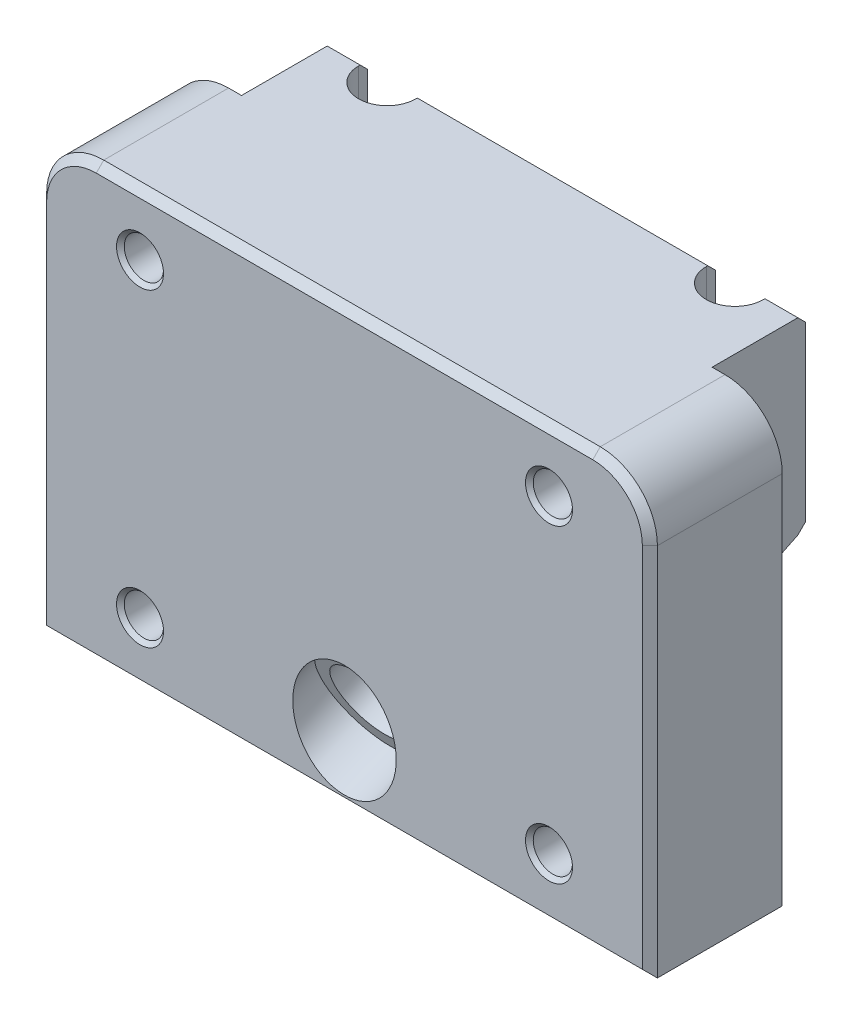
ISO-10303-21;
HEADER;
FILE_DESCRIPTION(('STEP AP214'),'2;1');
FILE_NAME('part.step','',(''),(''),'','','');
FILE_SCHEMA(('AUTOMOTIVE_DESIGN { 1 0 10303 214 1 1 1 1 }'));
ENDSEC;
DATA;
#1=APPLICATION_CONTEXT('core data for automotive mechanical design processes');
#2=APPLICATION_PROTOCOL_DEFINITION('international standard','automotive_design',2000,#1);
#3=PRODUCT_CONTEXT('',#1,'mechanical');
#4=PRODUCT('Part','Part','',(#3));
#5=PRODUCT_RELATED_PRODUCT_CATEGORY('part','',(#4));
#6=PRODUCT_DEFINITION_FORMATION('','',#4);
#7=PRODUCT_DEFINITION_CONTEXT('part definition',#1,'design');
#8=PRODUCT_DEFINITION('design','',#6,#7);
#9=PRODUCT_DEFINITION_SHAPE('','',#8);
#10=(LENGTH_UNIT() NAMED_UNIT(*) SI_UNIT(.MILLI.,.METRE.));
#11=(NAMED_UNIT(*) PLANE_ANGLE_UNIT() SI_UNIT($,.RADIAN.));
#12=(NAMED_UNIT(*) SI_UNIT($,.STERADIAN.) SOLID_ANGLE_UNIT());
#13=UNCERTAINTY_MEASURE_WITH_UNIT(LENGTH_MEASURE(1.E-05),#10,'distance_accuracy_value','');
#14=(GEOMETRIC_REPRESENTATION_CONTEXT(3) GLOBAL_UNCERTAINTY_ASSIGNED_CONTEXT((#13)) GLOBAL_UNIT_ASSIGNED_CONTEXT((#10,
#11,#12)) REPRESENTATION_CONTEXT('',''));
#15=CARTESIAN_POINT('',(0.,0.,0.));
#16=DIRECTION('',(0.,0.,1.));
#17=DIRECTION('',(1.,0.,0.));
#18=AXIS2_PLACEMENT_3D('',#15,#16,#17);
#19=CARTESIAN_POINT('',(39.751,72.898,-15.748));
#20=DIRECTION('',(0.,0.,1.));
#21=DIRECTION('',(1.,0.,0.));
#22=AXIS2_PLACEMENT_3D('',#19,#20,#21);
#23=PLANE('',#22);
#24=DIRECTION('',(0.,-1.,0.));
#25=VECTOR('',#24,1.);
#26=CARTESIAN_POINT('',(34.1884,72.898,-15.748));
#27=LINE('',#26,#25);
#28=CARTESIAN_POINT('',(34.1884,71.628,-15.748));
#29=VERTEX_POINT('',#28);
#30=CARTESIAN_POINT('',(34.1884,42.3653663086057,-15.748));
#31=VERTEX_POINT('',#30);
#32=EDGE_CURVE('E388',#29,#31,#27,.T.);
#33=ORIENTED_EDGE('',*,*,#32,.F.);
#34=DIRECTION('',(1.,0.,0.));
#35=VECTOR('',#34,1.);
#36=CARTESIAN_POINT('',(39.751,71.628,-15.748));
#37=LINE('',#36,#35);
#38=CARTESIAN_POINT('',(39.751,71.628,-15.748));
#39=VERTEX_POINT('',#38);
#40=EDGE_CURVE('E670',#29,#39,#37,.T.);
#41=ORIENTED_EDGE('',*,*,#40,.T.);
#42=DIRECTION('',(0.,-1.,0.));
#43=VECTOR('',#42,1.);
#44=CARTESIAN_POINT('',(39.751,72.898,-15.748));
#45=LINE('',#44,#43);
#46=CARTESIAN_POINT('',(39.751,42.3653663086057,-15.748));
#47=VERTEX_POINT('',#46);
#48=EDGE_CURVE('E625',#39,#47,#45,.T.);
#49=ORIENTED_EDGE('',*,*,#48,.T.);
#50=DIRECTION('',(-1.,0.,0.));
#51=VECTOR('',#50,1.);
#52=CARTESIAN_POINT('',(39.751,42.3653663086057,-15.748));
#53=LINE('',#52,#51);
#54=EDGE_CURVE('E701',#47,#31,#53,.T.);
#55=ORIENTED_EDGE('',*,*,#54,.T.);
#56=EDGE_LOOP('',(#33,#41,#49,#55));
#57=FACE_BOUND('',#56,.T.);
#58=ADVANCED_FACE('F15',(#57),#23,.F.);
#59=DIRECTION('',(0.,1.,0.));
#60=VECTOR('',#59,1.);
#61=CARTESIAN_POINT('',(24.5364,72.898,-15.748));
#62=LINE('',#61,#60);
#63=CARTESIAN_POINT('',(24.5364,42.3653663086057,-15.748));
#64=VERTEX_POINT('',#63);
#65=CARTESIAN_POINT('',(24.5364,71.628,-15.748));
#66=VERTEX_POINT('',#65);
#67=EDGE_CURVE('E382',#64,#66,#62,.T.);
#68=ORIENTED_EDGE('',*,*,#67,.F.);
#69=CARTESIAN_POINT('',(-24.5364,42.3653663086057,-15.748));
#70=VERTEX_POINT('',#69);
#71=EDGE_CURVE('E497',#64,#70,#53,.T.);
#72=ORIENTED_EDGE('',*,*,#71,.T.);
#73=DIRECTION('',(0.,1.,0.));
#74=VECTOR('',#73,1.);
#75=CARTESIAN_POINT('',(-24.5364,72.898,-15.748));
#76=LINE('',#75,#74);
#77=CARTESIAN_POINT('',(-24.5364,71.628,-15.748));
#78=VERTEX_POINT('',#77);
#79=EDGE_CURVE('E415',#70,#78,#76,.T.);
#80=ORIENTED_EDGE('',*,*,#79,.T.);
#81=EDGE_CURVE('E675',#78,#66,#37,.T.);
#82=ORIENTED_EDGE('',*,*,#81,.T.);
#83=EDGE_LOOP('',(#68,#72,#80,#82));
#84=FACE_BOUND('',#83,.T.);
#85=ADVANCED_FACE('F799',(#84),#23,.F.);
#86=CARTESIAN_POINT('',(-51.5874,72.898,-14.478));
#87=DIRECTION('',(0.,-0.707106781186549,0.707106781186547));
#88=DIRECTION('',(0.,-0.707106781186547,-0.707106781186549));
#89=AXIS2_PLACEMENT_3D('',#86,#87,#88);
#90=PLANE('',#89);
#91=ORIENTED_EDGE('',*,*,#40,.F.);
#92=DIRECTION('',(0.,-0.707106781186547,-0.707106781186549));
#93=VECTOR('',#92,1.);
#94=CARTESIAN_POINT('',(34.1884,72.898,-14.478));
#95=LINE('',#94,#93);
#96=CARTESIAN_POINT('',(34.1884,72.898,-14.478));
#97=VERTEX_POINT('',#96);
#98=EDGE_CURVE('E390',#29,#97,#95,.F.);
#99=ORIENTED_EDGE('',*,*,#98,.T.);
#100=DIRECTION('',(-1.,0.,0.));
#101=VECTOR('',#100,1.);
#102=CARTESIAN_POINT('',(-51.5874,72.898,-14.478));
#103=LINE('',#102,#101);
#104=CARTESIAN_POINT('',(39.751,72.898,-14.478));
#105=VERTEX_POINT('',#104);
#106=EDGE_CURVE('E665',#105,#97,#103,.T.);
#107=ORIENTED_EDGE('',*,*,#106,.F.);
#108=DIRECTION('',(0.,-0.707106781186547,-0.707106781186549));
#109=VECTOR('',#108,1.);
#110=CARTESIAN_POINT('',(39.751,72.898,-14.478));
#111=LINE('',#110,#109);
#112=EDGE_CURVE('E674',#39,#105,#111,.F.);
#113=ORIENTED_EDGE('',*,*,#112,.F.);
#114=EDGE_LOOP('',(#91,#99,#107,#113));
#115=FACE_BOUND('',#114,.T.);
#116=ADVANCED_FACE('F804',(#115),#90,.F.);
#117=CARTESIAN_POINT('',(24.5364,72.898,-14.478));
#118=VERTEX_POINT('',#117);
#119=CARTESIAN_POINT('',(-24.5364,72.898,-14.478));
#120=VERTEX_POINT('',#119);
#121=EDGE_CURVE('E668',#118,#120,#103,.T.);
#122=ORIENTED_EDGE('',*,*,#121,.F.);
#123=DIRECTION('',(0.,0.707106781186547,0.707106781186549));
#124=VECTOR('',#123,1.);
#125=CARTESIAN_POINT('',(24.5364,72.898,-14.478));
#126=LINE('',#125,#124);
#127=EDGE_CURVE('E369',#118,#66,#126,.F.);
#128=ORIENTED_EDGE('',*,*,#127,.T.);
#129=ORIENTED_EDGE('',*,*,#81,.F.);
#130=DIRECTION('',(0.,0.707106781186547,0.707106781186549));
#131=VECTOR('',#130,1.);
#132=CARTESIAN_POINT('',(-24.5364,72.898,-14.478));
#133=LINE('',#132,#131);
#134=EDGE_CURVE('E418',#120,#78,#133,.F.);
#135=ORIENTED_EDGE('',*,*,#134,.F.);
#136=EDGE_LOOP('',(#122,#128,#129,#135));
#137=FACE_BOUND('',#136,.T.);
#138=ADVANCED_FACE('F1143',(#137),#90,.F.);
#139=CARTESIAN_POINT('',(39.751,42.3653663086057,-15.748));
#140=DIRECTION('',(0.,0.707106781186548,0.707106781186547));
#141=DIRECTION('',(0.,-0.707106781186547,0.707106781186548));
#142=AXIS2_PLACEMENT_3D('',#139,#140,#141);
#143=PLANE('',#142);
#144=DIRECTION('',(1.,0.,0.));
#145=VECTOR('',#144,1.);
#146=CARTESIAN_POINT('',(241.924735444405,41.1009876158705,-14.4836213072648));
#147=LINE('',#146,#145);
#148=CARTESIAN_POINT('',(34.1884,41.1009876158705,-14.4836213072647));
#149=VERTEX_POINT('',#148);
#150=CARTESIAN_POINT('',(39.751,41.1009876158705,-14.4836213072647));
#151=VERTEX_POINT('',#150);
#152=EDGE_CURVE('E501',#149,#151,#147,.T.);
#153=ORIENTED_EDGE('',*,*,#152,.F.);
#154=DIRECTION('',(0.,-0.707106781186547,0.707106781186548));
#155=VECTOR('',#154,1.);
#156=CARTESIAN_POINT('',(34.1884,42.3653663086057,-15.748));
#157=LINE('',#156,#155);
#158=EDGE_CURVE('E385',#149,#31,#157,.F.);
#159=ORIENTED_EDGE('',*,*,#158,.T.);
#160=ORIENTED_EDGE('',*,*,#54,.F.);
#161=DIRECTION('',(0.,-0.707106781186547,0.707106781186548));
#162=VECTOR('',#161,1.);
#163=CARTESIAN_POINT('',(39.751,42.3653663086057,-15.748));
#164=LINE('',#163,#162);
#165=EDGE_CURVE('E504',#151,#47,#164,.F.);
#166=ORIENTED_EDGE('',*,*,#165,.F.);
#167=EDGE_LOOP('',(#153,#159,#160,#166));
#168=FACE_BOUND('',#167,.T.);
#169=ADVANCED_FACE('F1121',(#168),#143,.F.);
#170=ORIENTED_EDGE('',*,*,#71,.F.);
#171=DIRECTION('',(0.,0.707106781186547,-0.707106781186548));
#172=VECTOR('',#171,1.);
#173=CARTESIAN_POINT('',(24.5364,42.3653663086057,-15.748));
#174=LINE('',#173,#172);
#175=CARTESIAN_POINT('',(24.5364,41.1009876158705,-14.4836213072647));
#176=VERTEX_POINT('',#175);
#177=EDGE_CURVE('E378',#64,#176,#174,.F.);
#178=ORIENTED_EDGE('',*,*,#177,.T.);
#179=CARTESIAN_POINT('',(-24.5364,41.1009876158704,-14.4836213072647));
#180=VERTEX_POINT('',#179);
#181=EDGE_CURVE('E496',#180,#176,#147,.T.);
#182=ORIENTED_EDGE('',*,*,#181,.F.);
#183=DIRECTION('',(0.,0.707106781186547,-0.707106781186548));
#184=VECTOR('',#183,1.);
#185=CARTESIAN_POINT('',(-24.5364,42.3653663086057,-15.748));
#186=LINE('',#185,#184);
#187=EDGE_CURVE('E481',#70,#180,#186,.F.);
#188=ORIENTED_EDGE('',*,*,#187,.F.);
#189=EDGE_LOOP('',(#170,#178,#182,#188));
#190=FACE_BOUND('',#189,.T.);
#191=ADVANCED_FACE('F494',(#190),#143,.F.);
#192=CARTESIAN_POINT('',(-51.5874,72.898,22.352));
#193=DIRECTION('',(0.,-1.,0.));
#194=DIRECTION('',(0.,0.,-1.));
#195=AXIS2_PLACEMENT_3D('',#192,#193,#194);
#196=PLANE('',#195);
#197=DIRECTION('',(0.,0.,1.));
#198=VECTOR('',#197,1.);
#199=CARTESIAN_POINT('',(34.1884,72.898,-20.5806313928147));
#200=LINE('',#199,#198);
#201=CARTESIAN_POINT('',(34.1884,72.898,-14.224));
#202=VERTEX_POINT('',#201);
#203=EDGE_CURVE('E363',#97,#202,#200,.T.);
#204=ORIENTED_EDGE('',*,*,#203,.T.);
#205=CARTESIAN_POINT('',(29.3624,72.898,-14.224));
#206=DIRECTION('',(0.,-1.,0.));
#207=DIRECTION('',(0.,0.,1.));
#208=AXIS2_PLACEMENT_3D('',#205,#206,#207);
#209=CIRCLE('',#208,4.826);
#210=CARTESIAN_POINT('',(24.5364,72.898,-14.224));
#211=VERTEX_POINT('',#210);
#212=EDGE_CURVE('E358',#202,#211,#209,.T.);
#213=ORIENTED_EDGE('',*,*,#212,.T.);
#214=DIRECTION('',(0.,0.,-1.));
#215=VECTOR('',#214,1.);
#216=CARTESIAN_POINT('',(24.5364,72.898,-14.224));
#217=LINE('',#216,#215);
#218=EDGE_CURVE('E366',#211,#118,#217,.T.);
#219=ORIENTED_EDGE('',*,*,#218,.T.);
#220=ORIENTED_EDGE('',*,*,#121,.T.);
#221=DIRECTION('',(0.,0.,-1.));
#222=VECTOR('',#221,1.);
#223=CARTESIAN_POINT('',(-24.5364,72.898,-14.224));
#224=LINE('',#223,#222);
#225=CARTESIAN_POINT('',(-24.5364,72.898,-14.224));
#226=VERTEX_POINT('',#225);
#227=EDGE_CURVE('E399',#226,#120,#224,.T.);
#228=ORIENTED_EDGE('',*,*,#227,.F.);
#229=CARTESIAN_POINT('',(-29.3624,72.898,-14.224));
#230=DIRECTION('',(0.,1.,0.));
#231=DIRECTION('',(0.,0.,1.));
#232=AXIS2_PLACEMENT_3D('',#229,#230,#231);
#233=CIRCLE('',#232,4.826);
#234=CARTESIAN_POINT('',(-34.1884,72.898,-14.224));
#235=VERTEX_POINT('',#234);
#236=EDGE_CURVE('E396',#235,#226,#233,.T.);
#237=ORIENTED_EDGE('',*,*,#236,.F.);
#238=DIRECTION('',(0.,0.,1.));
#239=VECTOR('',#238,1.);
#240=CARTESIAN_POINT('',(-34.1884,72.898,-20.5806313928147));
#241=LINE('',#240,#239);
#242=CARTESIAN_POINT('',(-34.1884,72.898,-14.478));
#243=VERTEX_POINT('',#242);
#244=EDGE_CURVE('E393',#243,#235,#241,.T.);
#245=ORIENTED_EDGE('',*,*,#244,.F.);
#246=CARTESIAN_POINT('',(-39.751,72.898,-14.478));
#247=VERTEX_POINT('',#246);
#248=EDGE_CURVE('E664',#243,#247,#103,.T.);
#249=ORIENTED_EDGE('',*,*,#248,.T.);
#250=DIRECTION('',(0.,0.,1.));
#251=VECTOR('',#250,1.);
#252=CARTESIAN_POINT('',(-39.751,72.898,0.));
#253=LINE('',#252,#251);
#254=CARTESIAN_POINT('',(-39.751,72.898,0.));
#255=VERTEX_POINT('',#254);
#256=EDGE_CURVE('E642',#247,#255,#253,.T.);
#257=ORIENTED_EDGE('',*,*,#256,.T.);
#258=DIRECTION('',(-1.,0.,0.));
#259=VECTOR('',#258,1.);
#260=CARTESIAN_POINT('',(51.5874,72.898,0.));
#261=LINE('',#260,#259);
#262=CARTESIAN_POINT('',(-41.9354,72.898,0.));
#263=VERTEX_POINT('',#262);
#264=EDGE_CURVE('E612',#255,#263,#261,.T.);
#265=ORIENTED_EDGE('',*,*,#264,.T.);
#266=DIRECTION('',(0.,0.,-1.));
#267=VECTOR('',#266,1.);
#268=CARTESIAN_POINT('',(-41.9354,72.898,22.352));
#269=LINE('',#268,#267);
#270=CARTESIAN_POINT('',(-41.9354,72.898,21.082));
#271=VERTEX_POINT('',#270);
#272=EDGE_CURVE('E619',#263,#271,#269,.F.);
#273=ORIENTED_EDGE('',*,*,#272,.T.);
#274=DIRECTION('',(1.,0.,0.));
#275=VECTOR('',#274,1.);
#276=CARTESIAN_POINT('',(-51.5874,72.898,21.082));
#277=LINE('',#276,#275);
#278=CARTESIAN_POINT('',(41.9354,72.898,21.082));
#279=VERTEX_POINT('',#278);
#280=EDGE_CURVE('E659',#271,#279,#277,.T.);
#281=ORIENTED_EDGE('',*,*,#280,.T.);
#282=DIRECTION('',(0.,0.,-1.));
#283=VECTOR('',#282,1.);
#284=CARTESIAN_POINT('',(41.9354,72.898,22.352));
#285=LINE('',#284,#283);
#286=CARTESIAN_POINT('',(41.9354,72.898,0.));
#287=VERTEX_POINT('',#286);
#288=EDGE_CURVE('E639',#279,#287,#285,.T.);
#289=ORIENTED_EDGE('',*,*,#288,.T.);
#290=CARTESIAN_POINT('',(39.751,72.898,0.));
#291=VERTEX_POINT('',#290);
#292=EDGE_CURVE('E615',#287,#291,#261,.T.);
#293=ORIENTED_EDGE('',*,*,#292,.T.);
#294=DIRECTION('',(0.,0.,1.));
#295=VECTOR('',#294,1.);
#296=CARTESIAN_POINT('',(39.751,72.898,0.));
#297=LINE('',#296,#295);
#298=EDGE_CURVE('E600',#105,#291,#297,.T.);
#299=ORIENTED_EDGE('',*,*,#298,.F.);
#300=ORIENTED_EDGE('',*,*,#106,.T.);
#301=EDGE_LOOP('',(#204,#213,#219,#220,#228,#237,#245,#249,#257,#265,#273,#281,#289,#293,#299,#300));
#302=FACE_BOUND('',#301,.T.);
#303=ADVANCED_FACE('F373',(#302),#196,.F.);
#304=CARTESIAN_POINT('',(241.924735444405,34.0368535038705,0.));
#305=DIRECTION('',(0.,0.898794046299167,0.438371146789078));
#306=DIRECTION('',(0.,-0.438371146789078,0.898794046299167));
#307=AXIS2_PLACEMENT_3D('',#304,#305,#306);
#308=PLANE('',#307);
#309=DIRECTION('',(0.,-0.438371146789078,0.898794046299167));
#310=VECTOR('',#309,1.);
#311=CARTESIAN_POINT('',(34.1884,34.0368535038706,-1.83331914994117E-13));
#312=LINE('',#311,#310);
#313=CARTESIAN_POINT('',(34.1884,40.9743618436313,-14.224));
#314=VERTEX_POINT('',#313);
#315=EDGE_CURVE('E9',#149,#314,#312,.T.);
#316=ORIENTED_EDGE('',*,*,#315,.F.);
#317=ORIENTED_EDGE('',*,*,#152,.T.);
#318=DIRECTION('',(0.,0.438371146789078,-0.898794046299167));
#319=VECTOR('',#318,1.);
#320=CARTESIAN_POINT('',(39.751,41.5047713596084,-15.3115006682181));
#321=LINE('',#320,#319);
#322=CARTESIAN_POINT('',(39.751,34.7326222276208,-1.42653728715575));
#323=VERTEX_POINT('',#322);
#324=EDGE_CURVE('E601',#323,#151,#321,.T.);
#325=ORIENTED_EDGE('',*,*,#324,.F.);
#326=DIRECTION('',(-1.,0.,0.));
#327=VECTOR('',#326,1.);
#328=CARTESIAN_POINT('',(-39.751,34.7326222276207,-1.42653728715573));
#329=LINE('',#328,#327);
#330=CARTESIAN_POINT('',(-39.751,34.7326222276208,-1.42653728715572));
#331=VERTEX_POINT('',#330);
#332=EDGE_CURVE('E510',#323,#331,#329,.T.);
#333=ORIENTED_EDGE('',*,*,#332,.T.);
#334=DIRECTION('',(0.,0.438371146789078,-0.898794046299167));
#335=VECTOR('',#334,1.);
#336=CARTESIAN_POINT('',(-39.751,41.5047713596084,-15.3115006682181));
#337=LINE('',#336,#335);
#338=CARTESIAN_POINT('',(-39.751,41.1009876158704,-14.4836213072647));
#339=VERTEX_POINT('',#338);
#340=EDGE_CURVE('E604',#331,#339,#337,.T.);
#341=ORIENTED_EDGE('',*,*,#340,.T.);
#342=CARTESIAN_POINT('',(-34.1884,41.1009876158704,-14.4836213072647));
#343=VERTEX_POINT('',#342);
#344=EDGE_CURVE('E500',#339,#343,#147,.T.);
#345=ORIENTED_EDGE('',*,*,#344,.T.);
#346=DIRECTION('',(0.,-0.438371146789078,0.898794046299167));
#347=VECTOR('',#346,1.);
#348=CARTESIAN_POINT('',(-34.1884,34.0368535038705,2.43339809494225E-13));
#349=LINE('',#348,#347);
#350=CARTESIAN_POINT('',(-34.1884,40.9743618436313,-14.224));
#351=VERTEX_POINT('',#350);
#352=EDGE_CURVE('E38',#343,#351,#349,.T.);
#353=ORIENTED_EDGE('',*,*,#352,.T.);
#354=CARTESIAN_POINT('',(-29.3624,40.9743618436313,-14.224));
#355=DIRECTION('',(0.,0.898794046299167,0.438371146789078));
#356=DIRECTION('',(0.,0.438371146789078,-0.898794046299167));
#357=AXIS2_PLACEMENT_3D('',#354,#355,#356);
#358=ELLIPSE('',#357,5.36941696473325,4.826);
#359=CARTESIAN_POINT('',(-24.5364,40.9743618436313,-14.224));
#360=VERTEX_POINT('',#359);
#361=EDGE_CURVE('E484',#351,#360,#358,.T.);
#362=ORIENTED_EDGE('',*,*,#361,.T.);
#363=DIRECTION('',(0.,0.438371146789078,-0.898794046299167));
#364=VECTOR('',#363,1.);
#365=CARTESIAN_POINT('',(-24.5364,34.0368535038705,0.));
#366=LINE('',#365,#364);
#367=EDGE_CURVE('E412',#360,#180,#366,.T.);
#368=ORIENTED_EDGE('',*,*,#367,.T.);
#369=ORIENTED_EDGE('',*,*,#181,.T.);
#370=DIRECTION('',(0.,0.438371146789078,-0.898794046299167));
#371=VECTOR('',#370,1.);
#372=CARTESIAN_POINT('',(24.5364,34.0368535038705,0.));
#373=LINE('',#372,#371);
#374=CARTESIAN_POINT('',(24.5364,40.9743618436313,-14.224));
#375=VERTEX_POINT('',#374);
#376=EDGE_CURVE('E487',#375,#176,#373,.T.);
#377=ORIENTED_EDGE('',*,*,#376,.F.);
#378=CARTESIAN_POINT('',(29.3624,40.9743618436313,-14.224));
#379=DIRECTION('',(0.,0.898794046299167,0.438371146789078));
#380=DIRECTION('',(0.,0.438371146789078,-0.898794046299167));
#381=AXIS2_PLACEMENT_3D('',#378,#379,#380);
#382=ELLIPSE('',#381,5.36941696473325,4.826);
#383=EDGE_CURVE('E23',#314,#375,#382,.F.);
#384=ORIENTED_EDGE('',*,*,#383,.F.);
#385=EDGE_LOOP('',(#316,#317,#325,#333,#341,#345,#353,#362,#368,#369,#377,#384));
#386=FACE_BOUND('',#385,.T.);
#387=ADVANCED_FACE('F499',(#386),#308,.F.);
#388=CARTESIAN_POINT('',(0.,72.898,22.352));
#389=DIRECTION('',(0.,0.,-1.));
#390=DIRECTION('',(-1.,0.,0.));
#391=AXIS2_PLACEMENT_3D('',#388,#389,#390);
#392=PLANE('',#391);
#393=DIRECTION('',(0.999999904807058,-0.000436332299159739,0.));
#394=VECTOR('',#393,1.);
#395=CARTESIAN_POINT('',(38.512749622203,62.6092683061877,22.352));
#396=LINE('',#395,#394);
#397=CARTESIAN_POINT('',(38.5130036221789,62.6092681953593,22.352));
#398=VERTEX_POINT('',#397);
#399=CARTESIAN_POINT('',(38.512749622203,62.6092683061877,22.352));
#400=VERTEX_POINT('',#399);
#401=EDGE_CURVE('E886',#398,#400,#396,.F.);
#402=ORIENTED_EDGE('',*,*,#401,.F.);
#403=CARTESIAN_POINT('',(34.544,62.611,22.352));
#404=DIRECTION('',(0.,0.,1.));
#405=DIRECTION('',(1.,0.,0.));
#406=AXIS2_PLACEMENT_3D('',#403,#404,#405);
#407=CIRCLE('',#406,3.969004);
#408=CARTESIAN_POINT('',(38.513004,62.611,22.352));
#409=VERTEX_POINT('',#408);
#410=EDGE_CURVE('E863',#409,#398,#407,.T.);
#411=ORIENTED_EDGE('',*,*,#410,.F.);
#412=DIRECTION('',(1.,0.,0.));
#413=VECTOR('',#412,1.);
#414=CARTESIAN_POINT('',(38.51275,62.611,22.352));
#415=LINE('',#414,#413);
#416=CARTESIAN_POINT('',(38.51275,62.611,22.352));
#417=VERTEX_POINT('',#416);
#418=EDGE_CURVE('E882',#409,#417,#415,.F.);
#419=ORIENTED_EDGE('',*,*,#418,.T.);
#420=CARTESIAN_POINT('',(34.544,62.611,22.352));
#421=DIRECTION('',(0.,0.,-1.));
#422=DIRECTION('',(-1.,0.,0.));
#423=AXIS2_PLACEMENT_3D('',#420,#421,#422);
#424=CIRCLE('',#423,3.96875);
#425=EDGE_CURVE('E529',#417,#400,#424,.T.);
#426=ORIENTED_EDGE('',*,*,#425,.T.);
#427=EDGE_LOOP('',(#402,#411,#419,#426));
#428=FACE_BOUND('',#427,.T.);
#429=DIRECTION('',(0.999999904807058,-0.000436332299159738,0.));
#430=VECTOR('',#429,1.);
#431=CARTESIAN_POINT('',(-30.575250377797,62.6092683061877,22.352));
#432=LINE('',#431,#430);
#433=CARTESIAN_POINT('',(-30.5749963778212,62.6092681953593,22.352));
#434=VERTEX_POINT('',#433);
#435=CARTESIAN_POINT('',(-30.575250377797,62.6092683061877,22.352));
#436=VERTEX_POINT('',#435);
#437=EDGE_CURVE('E551',#434,#436,#432,.F.);
#438=ORIENTED_EDGE('',*,*,#437,.F.);
#439=CARTESIAN_POINT('',(-34.544,62.611,22.352));
#440=DIRECTION('',(0.,0.,1.));
#441=DIRECTION('',(1.,0.,0.));
#442=AXIS2_PLACEMENT_3D('',#439,#440,#441);
#443=CIRCLE('',#442,3.969004);
#444=CARTESIAN_POINT('',(-30.574996,62.611,22.352));
#445=VERTEX_POINT('',#444);
#446=EDGE_CURVE('E1888',#445,#434,#443,.T.);
#447=ORIENTED_EDGE('',*,*,#446,.F.);
#448=DIRECTION('',(1.,0.,0.));
#449=VECTOR('',#448,1.);
#450=CARTESIAN_POINT('',(-30.57525,62.611,22.352));
#451=LINE('',#450,#449);
#452=CARTESIAN_POINT('',(-30.57525,62.611,22.352));
#453=VERTEX_POINT('',#452);
#454=EDGE_CURVE('E555',#445,#453,#451,.F.);
#455=ORIENTED_EDGE('',*,*,#454,.T.);
#456=CARTESIAN_POINT('',(-34.544,62.611,22.352));
#457=DIRECTION('',(0.,0.,-1.));
#458=DIRECTION('',(-1.,0.,0.));
#459=AXIS2_PLACEMENT_3D('',#456,#457,#458);
#460=CIRCLE('',#459,3.96875);
#461=EDGE_CURVE('E524',#453,#436,#460,.T.);
#462=ORIENTED_EDGE('',*,*,#461,.T.);
#463=EDGE_LOOP('',(#438,#447,#455,#462));
#464=FACE_BOUND('',#463,.T.);
#465=DIRECTION('',(0.,1.,0.));
#466=VECTOR('',#465,1.);
#467=CARTESIAN_POINT('',(50.3174,72.898,22.352));
#468=LINE('',#467,#466);
#469=CARTESIAN_POINT('',(50.3174,1.27,22.352));
#470=VERTEX_POINT('',#469);
#471=CARTESIAN_POINT('',(50.3174,63.246,22.352));
#472=VERTEX_POINT('',#471);
#473=EDGE_CURVE('E685',#470,#472,#468,.T.);
#474=ORIENTED_EDGE('',*,*,#473,.T.);
#475=CARTESIAN_POINT('',(41.9354,63.246,22.352));
#476=DIRECTION('',(0.,0.,-1.));
#477=DIRECTION('',(-1.,0.,0.));
#478=AXIS2_PLACEMENT_3D('',#475,#476,#477);
#479=CIRCLE('',#478,8.382);
#480=CARTESIAN_POINT('',(41.9354,71.628,22.352));
#481=VERTEX_POINT('',#480);
#482=EDGE_CURVE('E687',#472,#481,#479,.F.);
#483=ORIENTED_EDGE('',*,*,#482,.T.);
#484=DIRECTION('',(-1.,0.,0.));
#485=VECTOR('',#484,1.);
#486=CARTESIAN_POINT('',(0.,71.628,22.352));
#487=LINE('',#486,#485);
#488=CARTESIAN_POINT('',(-41.9354,71.628,22.352));
#489=VERTEX_POINT('',#488);
#490=EDGE_CURVE('E677',#481,#489,#487,.T.);
#491=ORIENTED_EDGE('',*,*,#490,.T.);
#492=CARTESIAN_POINT('',(-41.9354,63.246,22.352));
#493=DIRECTION('',(0.,0.,-1.));
#494=DIRECTION('',(-1.,0.,0.));
#495=AXIS2_PLACEMENT_3D('',#492,#493,#494);
#496=CIRCLE('',#495,8.382);
#497=CARTESIAN_POINT('',(-50.3174,63.246,22.352));
#498=VERTEX_POINT('',#497);
#499=EDGE_CURVE('E679',#489,#498,#496,.F.);
#500=ORIENTED_EDGE('',*,*,#499,.T.);
#501=DIRECTION('',(0.,-1.,0.));
#502=VECTOR('',#501,1.);
#503=CARTESIAN_POINT('',(-50.3174,0.,22.352));
#504=LINE('',#503,#502);
#505=CARTESIAN_POINT('',(-50.3174,1.27,22.352));
#506=VERTEX_POINT('',#505);
#507=EDGE_CURVE('E681',#498,#506,#504,.T.);
#508=ORIENTED_EDGE('',*,*,#507,.T.);
#509=DIRECTION('',(1.,0.,0.));
#510=VECTOR('',#509,1.);
#511=CARTESIAN_POINT('',(51.5874,1.27,22.352));
#512=LINE('',#511,#510);
#513=EDGE_CURVE('E683',#506,#470,#512,.T.);
#514=ORIENTED_EDGE('',*,*,#513,.T.);
#515=EDGE_LOOP('',(#474,#483,#491,#500,#508,#514));
#516=FACE_BOUND('',#515,.T.);
#517=CARTESIAN_POINT('',(0.,11.0937104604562,22.352));
#518=DIRECTION('',(0.,0.,-1.));
#519=DIRECTION('',(0.,1.,0.));
#520=AXIS2_PLACEMENT_3D('',#517,#518,#519);
#521=ELLIPSE('',#520,9.49218243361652,8.7376);
#522=CARTESIAN_POINT('',(0.,20.5858928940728,22.352));
#523=VERTEX_POINT('',#522);
#524=EDGE_CURVE('E605',#523,#523,#521,.F.);
#525=ORIENTED_EDGE('',*,*,#524,.F.);
#526=EDGE_LOOP('',(#525));
#527=FACE_BOUND('',#526,.T.);
#528=DIRECTION('',(0.999999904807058,-0.000436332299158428,0.));
#529=VECTOR('',#528,1.);
#530=CARTESIAN_POINT('',(38.512749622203,10.2852683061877,22.352));
#531=LINE('',#530,#529);
#532=CARTESIAN_POINT('',(38.5130036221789,10.2852681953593,22.352));
#533=VERTEX_POINT('',#532);
#534=CARTESIAN_POINT('',(38.512749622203,10.2852683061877,22.352));
#535=VERTEX_POINT('',#534);
#536=EDGE_CURVE('E851',#533,#535,#531,.F.);
#537=ORIENTED_EDGE('',*,*,#536,.F.);
#538=CARTESIAN_POINT('',(34.544,10.287,22.352));
#539=DIRECTION('',(0.,0.,1.));
#540=DIRECTION('',(1.,0.,0.));
#541=AXIS2_PLACEMENT_3D('',#538,#539,#540);
#542=CIRCLE('',#541,3.969004);
#543=CARTESIAN_POINT('',(38.513004,10.287,22.352));
#544=VERTEX_POINT('',#543);
#545=EDGE_CURVE('E899',#544,#533,#542,.T.);
#546=ORIENTED_EDGE('',*,*,#545,.F.);
#547=DIRECTION('',(1.,0.,0.));
#548=VECTOR('',#547,1.);
#549=CARTESIAN_POINT('',(38.51275,10.287,22.352));
#550=LINE('',#549,#548);
#551=CARTESIAN_POINT('',(38.51275,10.287,22.352));
#552=VERTEX_POINT('',#551);
#553=EDGE_CURVE('E941',#544,#552,#550,.F.);
#554=ORIENTED_EDGE('',*,*,#553,.T.);
#555=CARTESIAN_POINT('',(34.544,10.287,22.352));
#556=DIRECTION('',(0.,0.,-1.));
#557=DIRECTION('',(-1.,0.,0.));
#558=AXIS2_PLACEMENT_3D('',#555,#556,#557);
#559=CIRCLE('',#558,3.96875);
#560=EDGE_CURVE('E567',#552,#535,#559,.T.);
#561=ORIENTED_EDGE('',*,*,#560,.T.);
#562=EDGE_LOOP('',(#537,#546,#554,#561));
#563=FACE_BOUND('',#562,.T.);
#564=DIRECTION('',(0.999999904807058,-0.00043633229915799,0.));
#565=VECTOR('',#564,1.);
#566=CARTESIAN_POINT('',(-30.575250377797,10.2852683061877,22.352));
#567=LINE('',#566,#565);
#568=CARTESIAN_POINT('',(-30.5749963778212,10.2852681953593,22.352));
#569=VERTEX_POINT('',#568);
#570=CARTESIAN_POINT('',(-30.575250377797,10.2852683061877,22.352));
#571=VERTEX_POINT('',#570);
#572=EDGE_CURVE('E476',#569,#571,#567,.F.);
#573=ORIENTED_EDGE('',*,*,#572,.F.);
#574=CARTESIAN_POINT('',(-34.544,10.287,22.352));
#575=DIRECTION('',(0.,0.,1.));
#576=DIRECTION('',(1.,0.,0.));
#577=AXIS2_PLACEMENT_3D('',#574,#575,#576);
#578=CIRCLE('',#577,3.969004);
#579=CARTESIAN_POINT('',(-30.574996,10.287,22.352));
#580=VERTEX_POINT('',#579);
#581=EDGE_CURVE('E426',#580,#569,#578,.T.);
#582=ORIENTED_EDGE('',*,*,#581,.F.);
#583=DIRECTION('',(1.,0.,0.));
#584=VECTOR('',#583,1.);
#585=CARTESIAN_POINT('',(-30.57525,10.287,22.352));
#586=LINE('',#585,#584);
#587=CARTESIAN_POINT('',(-30.57525,10.287,22.352));
#588=VERTEX_POINT('',#587);
#589=EDGE_CURVE('E467',#580,#588,#586,.F.);
#590=ORIENTED_EDGE('',*,*,#589,.T.);
#591=CARTESIAN_POINT('',(-34.544,10.287,22.352));
#592=DIRECTION('',(0.,0.,-1.));
#593=DIRECTION('',(-1.,0.,0.));
#594=AXIS2_PLACEMENT_3D('',#591,#592,#593);
#595=CIRCLE('',#594,3.96875);
#596=EDGE_CURVE('E536',#588,#571,#595,.T.);
#597=ORIENTED_EDGE('',*,*,#596,.T.);
#598=EDGE_LOOP('',(#573,#582,#590,#597));
#599=FACE_BOUND('',#598,.T.);
#600=ADVANCED_FACE('F819',(#428,#464,#516,#527,#563,#599),#392,.F.);
#601=CARTESIAN_POINT('',(-39.751,72.898,0.));
#602=DIRECTION('',(-1.,0.,0.));
#603=DIRECTION('',(0.,0.,1.));
#604=AXIS2_PLACEMENT_3D('',#601,#602,#603);
#605=PLANE('',#604);
#606=DIRECTION('',(0.,-1.,0.));
#607=VECTOR('',#606,1.);
#608=CARTESIAN_POINT('',(-39.751,72.898,-15.748));
#609=LINE('',#608,#607);
#610=CARTESIAN_POINT('',(-39.751,71.628,-15.748));
#611=VERTEX_POINT('',#610);
#612=CARTESIAN_POINT('',(-39.751,42.3653663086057,-15.748));
#613=VERTEX_POINT('',#612);
#614=EDGE_CURVE('E622',#611,#613,#609,.T.);
#615=ORIENTED_EDGE('',*,*,#614,.T.);
#616=DIRECTION('',(0.,0.707106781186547,-0.707106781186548));
#617=VECTOR('',#616,1.);
#618=CARTESIAN_POINT('',(-39.751,49.7576831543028,-23.1403168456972));
#619=LINE('',#618,#617);
#620=EDGE_CURVE('E505',#613,#339,#619,.F.);
#621=ORIENTED_EDGE('',*,*,#620,.T.);
#622=ORIENTED_EDGE('',*,*,#340,.F.);
#623=CARTESIAN_POINT('',(-39.751,32.4496853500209,-2.54));
#624=DIRECTION('',(-1.,0.,0.));
#625=DIRECTION('',(0.,0.,1.));
#626=AXIS2_PLACEMENT_3D('',#623,#624,#625);
#627=CIRCLE('',#626,2.54);
#628=CARTESIAN_POINT('',(-39.751,32.4496853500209,0.));
#629=VERTEX_POINT('',#628);
#630=EDGE_CURVE('E516',#331,#629,#627,.F.);
#631=ORIENTED_EDGE('',*,*,#630,.T.);
#632=DIRECTION('',(0.,-1.,0.));
#633=VECTOR('',#632,1.);
#634=CARTESIAN_POINT('',(-39.751,72.898,0.));
#635=LINE('',#634,#633);
#636=EDGE_CURVE('E620',#255,#629,#635,.T.);
#637=ORIENTED_EDGE('',*,*,#636,.F.);
#638=ORIENTED_EDGE('',*,*,#256,.F.);
#639=DIRECTION('',(0.,0.707106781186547,0.707106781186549));
#640=VECTOR('',#639,1.);
#641=CARTESIAN_POINT('',(-39.751,80.137,-7.239));
#642=LINE('',#641,#640);
#643=EDGE_CURVE('E667',#247,#611,#642,.F.);
#644=ORIENTED_EDGE('',*,*,#643,.T.);
#645=EDGE_LOOP('',(#615,#621,#622,#631,#637,#638,#644));
#646=FACE_BOUND('',#645,.T.);
#647=ADVANCED_FACE('F718',(#646),#605,.T.);
#648=CARTESIAN_POINT('',(39.751,72.898,0.));
#649=DIRECTION('',(-1.,0.,0.));
#650=DIRECTION('',(0.,0.,1.));
#651=AXIS2_PLACEMENT_3D('',#648,#649,#650);
#652=PLANE('',#651);
#653=DIRECTION('',(0.,-1.,0.));
#654=VECTOR('',#653,1.);
#655=CARTESIAN_POINT('',(39.751,72.898,0.));
#656=LINE('',#655,#654);
#657=CARTESIAN_POINT('',(39.751,32.4496853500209,0.));
#658=VERTEX_POINT('',#657);
#659=EDGE_CURVE('E628',#291,#658,#656,.T.);
#660=ORIENTED_EDGE('',*,*,#659,.T.);
#661=CARTESIAN_POINT('',(39.751,32.4496853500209,-2.54));
#662=DIRECTION('',(-1.,0.,0.));
#663=DIRECTION('',(0.,0.,1.));
#664=AXIS2_PLACEMENT_3D('',#661,#662,#663);
#665=CIRCLE('',#664,2.54);
#666=EDGE_CURVE('E519',#658,#323,#665,.T.);
#667=ORIENTED_EDGE('',*,*,#666,.T.);
#668=ORIENTED_EDGE('',*,*,#324,.T.);
#669=ORIENTED_EDGE('',*,*,#165,.T.);
#670=ORIENTED_EDGE('',*,*,#48,.F.);
#671=ORIENTED_EDGE('',*,*,#112,.T.);
#672=ORIENTED_EDGE('',*,*,#298,.T.);
#673=EDGE_LOOP('',(#660,#667,#668,#669,#670,#671,#672));
#674=FACE_BOUND('',#673,.T.);
#675=ADVANCED_FACE('F809',(#674),#652,.F.);
#676=CARTESIAN_POINT('',(-34.1884,71.628,-15.748));
#677=VERTEX_POINT('',#676);
#678=EDGE_CURVE('E671',#611,#677,#37,.T.);
#679=ORIENTED_EDGE('',*,*,#678,.T.);
#680=DIRECTION('',(0.,-1.,0.));
#681=VECTOR('',#680,1.);
#682=CARTESIAN_POINT('',(-34.1884,72.898,-15.748));
#683=LINE('',#682,#681);
#684=CARTESIAN_POINT('',(-34.1884,42.3653663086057,-15.748));
#685=VERTEX_POINT('',#684);
#686=EDGE_CURVE('E407',#677,#685,#683,.T.);
#687=ORIENTED_EDGE('',*,*,#686,.T.);
#688=EDGE_CURVE('E700',#685,#613,#53,.T.);
#689=ORIENTED_EDGE('',*,*,#688,.T.);
#690=ORIENTED_EDGE('',*,*,#614,.F.);
#691=EDGE_LOOP('',(#679,#687,#689,#690));
#692=FACE_BOUND('',#691,.T.);
#693=ADVANCED_FACE('F711',(#692),#23,.F.);
#694=CARTESIAN_POINT('',(-51.5874,0.,22.352));
#695=DIRECTION('',(0.,-1.,0.));
#696=DIRECTION('',(0.,0.,-1.));
#697=AXIS2_PLACEMENT_3D('',#694,#695,#696);
#698=PLANE('',#697);
#699=DIRECTION('',(0.,0.,-1.));
#700=VECTOR('',#699,1.);
#701=CARTESIAN_POINT('',(51.5874,0.,22.352));
#702=LINE('',#701,#700);
#703=CARTESIAN_POINT('',(51.5874,0.,21.082));
#704=VERTEX_POINT('',#703);
#705=CARTESIAN_POINT('',(51.5874,0.,0.));
#706=VERTEX_POINT('',#705);
#707=EDGE_CURVE('E611',#704,#706,#702,.T.);
#708=ORIENTED_EDGE('',*,*,#707,.F.);
#709=DIRECTION('',(-1.,0.,0.));
#710=VECTOR('',#709,1.);
#711=CARTESIAN_POINT('',(-51.5874,0.,21.082));
#712=LINE('',#711,#710);
#713=CARTESIAN_POINT('',(-51.5874,0.,21.082));
#714=VERTEX_POINT('',#713);
#715=EDGE_CURVE('E695',#704,#714,#712,.T.);
#716=ORIENTED_EDGE('',*,*,#715,.T.);
#717=DIRECTION('',(0.,0.,-1.));
#718=VECTOR('',#717,1.);
#719=CARTESIAN_POINT('',(-51.5874,0.,22.352));
#720=LINE('',#719,#718);
#721=CARTESIAN_POINT('',(-51.5874,0.,0.));
#722=VERTEX_POINT('',#721);
#723=EDGE_CURVE('E607',#714,#722,#720,.T.);
#724=ORIENTED_EDGE('',*,*,#723,.T.);
#725=DIRECTION('',(-1.,0.,0.));
#726=VECTOR('',#725,1.);
#727=CARTESIAN_POINT('',(51.5874,0.,0.));
#728=LINE('',#727,#726);
#729=EDGE_CURVE('E608',#706,#722,#728,.T.);
#730=ORIENTED_EDGE('',*,*,#729,.F.);
#731=EDGE_LOOP('',(#708,#716,#724,#730));
#732=FACE_BOUND('',#731,.T.);
#733=ADVANCED_FACE('F776',(#732),#698,.T.);
#734=CARTESIAN_POINT('',(-51.5874,72.898,22.352));
#735=DIRECTION('',(-1.,0.,0.));
#736=DIRECTION('',(0.,0.,1.));
#737=AXIS2_PLACEMENT_3D('',#734,#735,#736);
#738=PLANE('',#737);
#739=ORIENTED_EDGE('',*,*,#723,.F.);
#740=DIRECTION('',(0.,1.,0.));
#741=VECTOR('',#740,1.);
#742=CARTESIAN_POINT('',(-51.5874,63.246,21.082));
#743=LINE('',#742,#741);
#744=CARTESIAN_POINT('',(-51.5874,63.246,21.082));
#745=VERTEX_POINT('',#744);
#746=EDGE_CURVE('E697',#714,#745,#743,.T.);
#747=ORIENTED_EDGE('',*,*,#746,.T.);
#748=DIRECTION('',(0.,0.,-1.));
#749=VECTOR('',#748,1.);
#750=CARTESIAN_POINT('',(-51.5874,63.246,0.));
#751=LINE('',#750,#749);
#752=CARTESIAN_POINT('',(-51.5874,63.246,0.));
#753=VERTEX_POINT('',#752);
#754=EDGE_CURVE('E655',#745,#753,#751,.T.);
#755=ORIENTED_EDGE('',*,*,#754,.T.);
#756=DIRECTION('',(0.,-1.,0.));
#757=VECTOR('',#756,1.);
#758=CARTESIAN_POINT('',(-51.5874,72.898,0.));
#759=LINE('',#758,#757);
#760=EDGE_CURVE('E616',#753,#722,#759,.T.);
#761=ORIENTED_EDGE('',*,*,#760,.T.);
#762=EDGE_LOOP('',(#739,#747,#755,#761));
#763=FACE_BOUND('',#762,.T.);
#764=ADVANCED_FACE('F781',(#763),#738,.T.);
#765=CARTESIAN_POINT('',(51.5874,72.898,0.));
#766=DIRECTION('',(0.,0.,1.));
#767=DIRECTION('',(1.,0.,0.));
#768=AXIS2_PLACEMENT_3D('',#765,#766,#767);
#769=PLANE('',#768);
#770=ORIENTED_EDGE('',*,*,#636,.T.);
#771=DIRECTION('',(-1.,0.,0.));
#772=VECTOR('',#771,1.);
#773=CARTESIAN_POINT('',(39.751,32.4496853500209,0.));
#774=LINE('',#773,#772);
#775=EDGE_CURVE('E513',#629,#658,#774,.F.);
#776=ORIENTED_EDGE('',*,*,#775,.T.);
#777=ORIENTED_EDGE('',*,*,#659,.F.);
#778=ORIENTED_EDGE('',*,*,#292,.F.);
#779=CARTESIAN_POINT('',(41.9354,63.246,0.));
#780=DIRECTION('',(0.,0.,1.));
#781=DIRECTION('',(1.,0.,0.));
#782=AXIS2_PLACEMENT_3D('',#779,#780,#781);
#783=CIRCLE('',#782,9.652);
#784=CARTESIAN_POINT('',(51.5874,63.246,0.));
#785=VERTEX_POINT('',#784);
#786=EDGE_CURVE('E638',#287,#785,#783,.F.);
#787=ORIENTED_EDGE('',*,*,#786,.T.);
#788=DIRECTION('',(0.,-1.,0.));
#789=VECTOR('',#788,1.);
#790=CARTESIAN_POINT('',(51.5874,72.898,0.));
#791=LINE('',#790,#789);
#792=EDGE_CURVE('E614',#785,#706,#791,.T.);
#793=ORIENTED_EDGE('',*,*,#792,.T.);
#794=ORIENTED_EDGE('',*,*,#729,.T.);
#795=ORIENTED_EDGE('',*,*,#760,.F.);
#796=CARTESIAN_POINT('',(-41.9354,63.246,0.));
#797=DIRECTION('',(0.,0.,1.));
#798=DIRECTION('',(1.,0.,0.));
#799=AXIS2_PLACEMENT_3D('',#796,#797,#798);
#800=CIRCLE('',#799,9.652);
#801=EDGE_CURVE('E635',#753,#263,#800,.F.);
#802=ORIENTED_EDGE('',*,*,#801,.T.);
#803=ORIENTED_EDGE('',*,*,#264,.F.);
#804=EDGE_LOOP('',(#770,#776,#777,#778,#787,#793,#794,#795,#802,#803));
#805=FACE_BOUND('',#804,.T.);
#806=CARTESIAN_POINT('',(0.,20.5815715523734,0.));
#807=DIRECTION('',(0.,0.,1.));
#808=DIRECTION('',(0.,-1.,0.));
#809=AXIS2_PLACEMENT_3D('',#806,#807,#808);
#810=ELLIPSE('',#809,6.90528678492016,6.35635);
#811=CARTESIAN_POINT('',(0.,13.6762847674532,0.));
#812=VERTEX_POINT('',#811);
#813=EDGE_CURVE('E646',#812,#812,#810,.T.);
#814=ORIENTED_EDGE('',*,*,#813,.T.);
#815=EDGE_LOOP('',(#814));
#816=FACE_BOUND('',#815,.T.);
#817=ADVANCED_FACE('F742',(#805,#816),#769,.F.);
#818=CARTESIAN_POINT('',(51.5874,72.898,22.352));
#819=DIRECTION('',(-1.,0.,0.));
#820=DIRECTION('',(0.,0.,1.));
#821=AXIS2_PLACEMENT_3D('',#818,#819,#820);
#822=PLANE('',#821);
#823=DIRECTION('',(0.,0.,-1.));
#824=VECTOR('',#823,1.);
#825=CARTESIAN_POINT('',(51.5874,63.246,22.352));
#826=LINE('',#825,#824);
#827=CARTESIAN_POINT('',(51.5874,63.246,21.082));
#828=VERTEX_POINT('',#827);
#829=EDGE_CURVE('E641',#785,#828,#826,.F.);
#830=ORIENTED_EDGE('',*,*,#829,.T.);
#831=DIRECTION('',(0.,-1.,0.));
#832=VECTOR('',#831,1.);
#833=CARTESIAN_POINT('',(51.5874,72.898,21.082));
#834=LINE('',#833,#832);
#835=EDGE_CURVE('E693',#828,#704,#834,.T.);
#836=ORIENTED_EDGE('',*,*,#835,.T.);
#837=ORIENTED_EDGE('',*,*,#707,.T.);
#838=ORIENTED_EDGE('',*,*,#792,.F.);
#839=EDGE_LOOP('',(#830,#836,#837,#838));
#840=FACE_BOUND('',#839,.T.);
#841=ADVANCED_FACE('F772',(#840),#822,.F.);
#842=CARTESIAN_POINT('',(0.,2.48561801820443,42.6313949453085));
#843=DIRECTION('',(0.,0.390731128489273,-0.92050485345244));
#844=DIRECTION('',(0.,0.92050485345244,0.390731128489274));
#845=AXIS2_PLACEMENT_3D('',#842,#843,#844);
#846=CYLINDRICAL_SURFACE('',#845,8.7376);
#847=CARTESIAN_POINT('',(0.,12.9293429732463,18.0275208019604));
#848=DIRECTION('',(0.,-0.390731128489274,0.920504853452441));
#849=DIRECTION('',(0.,-0.92050485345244,-0.390731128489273));
#850=AXIS2_PLACEMENT_3D('',#847,#848,#849);
#851=CIRCLE('',#850,8.7376);
#852=CARTESIAN_POINT('',(0.,4.8863397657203,14.6134684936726));
#853=VERTEX_POINT('',#852);
#854=EDGE_CURVE('E634',#853,#853,#851,.T.);
#855=ORIENTED_EDGE('',*,*,#854,.F.);
#856=EDGE_LOOP('',(#855));
#857=FACE_BOUND('',#856,.T.);
#858=ORIENTED_EDGE('',*,*,#524,.T.);
#859=EDGE_LOOP('',(#858));
#860=FACE_BOUND('',#859,.T.);
#861=ADVANCED_FACE('F825',(#857,#860),#846,.F.);
#862=CARTESIAN_POINT('',(0.,12.9293429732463,18.0275208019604));
#863=DIRECTION('',(0.,-0.390731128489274,0.920504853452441));
#864=DIRECTION('',(0.,-0.92050485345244,-0.390731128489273));
#865=AXIS2_PLACEMENT_3D('',#862,#863,#864);
#866=PLANE('',#865);
#867=CARTESIAN_POINT('',(0.,12.9293429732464,18.0275208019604));
#868=DIRECTION('',(0.,-0.390731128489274,0.920504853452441));
#869=DIRECTION('',(0.,-0.92050485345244,-0.390731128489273));
#870=AXIS2_PLACEMENT_3D('',#867,#868,#869);
#871=CIRCLE('',#870,6.35635);
#872=CARTESIAN_POINT('',(0.,7.07829194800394,15.5438969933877));
#873=VERTEX_POINT('',#872);
#874=EDGE_CURVE('E644',#873,#873,#871,.T.);
#875=ORIENTED_EDGE('',*,*,#874,.F.);
#876=EDGE_LOOP('',(#875));
#877=FACE_BOUND('',#876,.T.);
#878=ORIENTED_EDGE('',*,*,#854,.T.);
#879=EDGE_LOOP('',(#878));
#880=FACE_BOUND('',#879,.T.);
#881=ADVANCED_FACE('F834',(#877,#880),#866,.T.);
#882=CARTESIAN_POINT('',(0.,22.3347593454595,-4.13025161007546));
#883=DIRECTION('',(0.,-0.390731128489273,0.92050485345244));
#884=DIRECTION('',(0.,-0.92050485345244,-0.390731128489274));
#885=AXIS2_PLACEMENT_3D('',#882,#883,#884);
#886=CYLINDRICAL_SURFACE('',#885,6.35635);
#887=ORIENTED_EDGE('',*,*,#874,.T.);
#888=EDGE_LOOP('',(#887));
#889=FACE_BOUND('',#888,.T.);
#890=ORIENTED_EDGE('',*,*,#813,.F.);
#891=EDGE_LOOP('',(#890));
#892=FACE_BOUND('',#891,.T.);
#893=ADVANCED_FACE('F795',(#889,#892),#886,.F.);
#894=CARTESIAN_POINT('',(41.9354,63.246,22.352));
#895=DIRECTION('',(0.,0.,-1.));
#896=DIRECTION('',(-1.,0.,0.));
#897=AXIS2_PLACEMENT_3D('',#894,#895,#896);
#898=CYLINDRICAL_SURFACE('',#897,9.652);
#899=ORIENTED_EDGE('',*,*,#288,.F.);
#900=CARTESIAN_POINT('',(41.9354,63.246,21.082));
#901=DIRECTION('',(0.,0.,-1.));
#902=DIRECTION('',(-1.,0.,0.));
#903=AXIS2_PLACEMENT_3D('',#900,#901,#902);
#904=CIRCLE('',#903,9.652);
#905=EDGE_CURVE('E690',#279,#828,#904,.T.);
#906=ORIENTED_EDGE('',*,*,#905,.T.);
#907=ORIENTED_EDGE('',*,*,#829,.F.);
#908=ORIENTED_EDGE('',*,*,#786,.F.);
#909=EDGE_LOOP('',(#899,#906,#907,#908));
#910=FACE_BOUND('',#909,.T.);
#911=ADVANCED_FACE('F768',(#910),#898,.T.);
#912=CARTESIAN_POINT('',(-41.9354,63.246,22.352));
#913=DIRECTION('',(0.,0.,1.));
#914=DIRECTION('',(1.,0.,0.));
#915=AXIS2_PLACEMENT_3D('',#912,#913,#914);
#916=CYLINDRICAL_SURFACE('',#915,9.652);
#917=ORIENTED_EDGE('',*,*,#754,.F.);
#918=CARTESIAN_POINT('',(-41.9354,63.246,21.082));
#919=DIRECTION('',(0.,0.,-1.));
#920=DIRECTION('',(-1.,0.,0.));
#921=AXIS2_PLACEMENT_3D('',#918,#919,#920);
#922=CIRCLE('',#921,9.652);
#923=EDGE_CURVE('E699',#745,#271,#922,.T.);
#924=ORIENTED_EDGE('',*,*,#923,.T.);
#925=ORIENTED_EDGE('',*,*,#272,.F.);
#926=ORIENTED_EDGE('',*,*,#801,.F.);
#927=EDGE_LOOP('',(#917,#924,#925,#926));
#928=FACE_BOUND('',#927,.T.);
#929=ADVANCED_FACE('F784',(#928),#916,.T.);
#930=CARTESIAN_POINT('',(-34.544,62.611,5.1816));
#931=DIRECTION('',(0.,0.,1.));
#932=DIRECTION('',(1.,0.,0.));
#933=AXIS2_PLACEMENT_3D('',#930,#931,#932);
#934=CYLINDRICAL_SURFACE('',#933,3.3147);
#935=CARTESIAN_POINT('',(-34.544,62.611,21.69795));
#936=DIRECTION('',(0.,0.,-1.));
#937=DIRECTION('',(-1.,0.,0.));
#938=AXIS2_PLACEMENT_3D('',#935,#936,#937);
#939=CIRCLE('',#938,3.3147);
#940=CARTESIAN_POINT('',(-37.8587,62.611,21.69795));
#941=VERTEX_POINT('',#940);
#942=EDGE_CURVE('E482',#941,#941,#939,.F.);
#943=ORIENTED_EDGE('',*,*,#942,.T.);
#944=EDGE_LOOP('',(#943));
#945=FACE_BOUND('',#944,.T.);
#946=CARTESIAN_POINT('',(-34.544,62.611,5.207));
#947=DIRECTION('',(0.,0.,-1.));
#948=DIRECTION('',(-1.,0.,0.));
#949=AXIS2_PLACEMENT_3D('',#946,#947,#948);
#950=CIRCLE('',#949,3.3147);
#951=CARTESIAN_POINT('',(-37.8587,62.611,5.207));
#952=VERTEX_POINT('',#951);
#953=EDGE_CURVE('E597',#952,#952,#950,.T.);
#954=ORIENTED_EDGE('',*,*,#953,.T.);
#955=EDGE_LOOP('',(#954));
#956=FACE_BOUND('',#955,.T.);
#957=ADVANCED_FACE('F786',(#945,#956),#934,.F.);
#958=CARTESIAN_POINT('',(34.544,10.287,5.1816));
#959=DIRECTION('',(0.,0.,1.));
#960=DIRECTION('',(1.,0.,0.));
#961=AXIS2_PLACEMENT_3D('',#958,#959,#960);
#962=CYLINDRICAL_SURFACE('',#961,3.3147);
#963=CARTESIAN_POINT('',(34.544,10.287,21.69795));
#964=DIRECTION('',(0.,0.,-1.));
#965=DIRECTION('',(-1.,0.,0.));
#966=AXIS2_PLACEMENT_3D('',#963,#964,#965);
#967=CIRCLE('',#966,3.3147);
#968=CARTESIAN_POINT('',(31.2293,10.287,21.69795));
#969=VERTEX_POINT('',#968);
#970=EDGE_CURVE('E525',#969,#969,#967,.F.);
#971=ORIENTED_EDGE('',*,*,#970,.T.);
#972=EDGE_LOOP('',(#971));
#973=FACE_BOUND('',#972,.T.);
#974=CARTESIAN_POINT('',(34.544,10.287,5.207));
#975=DIRECTION('',(0.,0.,-1.));
#976=DIRECTION('',(-1.,0.,0.));
#977=AXIS2_PLACEMENT_3D('',#974,#975,#976);
#978=CIRCLE('',#977,3.3147);
#979=CARTESIAN_POINT('',(31.2293,10.287,5.207));
#980=VERTEX_POINT('',#979);
#981=EDGE_CURVE('E591',#980,#980,#978,.T.);
#982=ORIENTED_EDGE('',*,*,#981,.T.);
#983=EDGE_LOOP('',(#982));
#984=FACE_BOUND('',#983,.T.);
#985=ADVANCED_FACE('F793',(#973,#984),#962,.F.);
#986=CARTESIAN_POINT('',(34.544,62.611,5.1816));
#987=DIRECTION('',(0.,0.,1.));
#988=DIRECTION('',(1.,0.,0.));
#989=AXIS2_PLACEMENT_3D('',#986,#987,#988);
#990=CYLINDRICAL_SURFACE('',#989,3.3147);
#991=CARTESIAN_POINT('',(34.544,62.611,21.69795));
#992=DIRECTION('',(0.,0.,-1.));
#993=DIRECTION('',(-1.,0.,0.));
#994=AXIS2_PLACEMENT_3D('',#991,#992,#993);
#995=CIRCLE('',#994,3.3147);
#996=CARTESIAN_POINT('',(31.2293,62.611,21.69795));
#997=VERTEX_POINT('',#996);
#998=EDGE_CURVE('E521',#997,#997,#995,.F.);
#999=ORIENTED_EDGE('',*,*,#998,.T.);
#1000=EDGE_LOOP('',(#999));
#1001=FACE_BOUND('',#1000,.T.);
#1002=CARTESIAN_POINT('',(34.544,62.611,5.207));
#1003=DIRECTION('',(0.,0.,-1.));
#1004=DIRECTION('',(-1.,0.,0.));
#1005=AXIS2_PLACEMENT_3D('',#1002,#1003,#1004);
#1006=CIRCLE('',#1005,3.3147);
#1007=CARTESIAN_POINT('',(31.2293,62.611,5.207));
#1008=VERTEX_POINT('',#1007);
#1009=EDGE_CURVE('E594',#1008,#1008,#1006,.T.);
#1010=ORIENTED_EDGE('',*,*,#1009,.T.);
#1011=EDGE_LOOP('',(#1010));
#1012=FACE_BOUND('',#1011,.T.);
#1013=ADVANCED_FACE('F1160',(#1001,#1012),#990,.F.);
#1014=CARTESIAN_POINT('',(-34.544,10.287,5.1816));
#1015=DIRECTION('',(0.,0.,1.));
#1016=DIRECTION('',(1.,0.,0.));
#1017=AXIS2_PLACEMENT_3D('',#1014,#1015,#1016);
#1018=CYLINDRICAL_SURFACE('',#1017,3.3147);
#1019=CARTESIAN_POINT('',(-34.544,10.287,21.69795));
#1020=DIRECTION('',(0.,0.,-1.));
#1021=DIRECTION('',(-1.,0.,0.));
#1022=AXIS2_PLACEMENT_3D('',#1019,#1020,#1021);
#1023=CIRCLE('',#1022,3.3147);
#1024=CARTESIAN_POINT('',(-37.8587,10.287,21.69795));
#1025=VERTEX_POINT('',#1024);
#1026=EDGE_CURVE('E528',#1025,#1025,#1023,.F.);
#1027=ORIENTED_EDGE('',*,*,#1026,.T.);
#1028=EDGE_LOOP('',(#1027));
#1029=FACE_BOUND('',#1028,.T.);
#1030=CARTESIAN_POINT('',(-34.544,10.287,5.207));
#1031=DIRECTION('',(0.,0.,-1.));
#1032=DIRECTION('',(-1.,0.,0.));
#1033=AXIS2_PLACEMENT_3D('',#1030,#1031,#1032);
#1034=CIRCLE('',#1033,3.3147);
#1035=CARTESIAN_POINT('',(-37.8587,10.287,5.207));
#1036=VERTEX_POINT('',#1035);
#1037=EDGE_CURVE('E588',#1036,#1036,#1034,.T.);
#1038=ORIENTED_EDGE('',*,*,#1037,.T.);
#1039=EDGE_LOOP('',(#1038));
#1040=FACE_BOUND('',#1039,.T.);
#1041=ADVANCED_FACE('F17',(#1029,#1040),#1018,.F.);
#1042=CARTESIAN_POINT('',(-34.544,62.611,5.207));
#1043=DIRECTION('',(0.,0.,1.));
#1044=DIRECTION('',(1.,0.,0.));
#1045=AXIS2_PLACEMENT_3D('',#1042,#1043,#1044);
#1046=CONICAL_SURFACE('',#1045,3.3147,1.02974425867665);
#1047=ORIENTED_EDGE('',*,*,#953,.F.);
#1048=EDGE_LOOP('',(#1047));
#1049=FACE_BOUND('',#1048,.T.);
#1050=CARTESIAN_POINT('',(-34.544,62.611,3.21532730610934));
#1051=VERTEX_POINT('',#1050);
#1052=VERTEX_LOOP('',#1051);
#1053=FACE_BOUND('',#1052,.T.);
#1054=ADVANCED_FACE('F1153',(#1049,#1053),#1046,.F.);
#1055=CARTESIAN_POINT('',(34.544,62.611,5.207));
#1056=DIRECTION('',(0.,0.,1.));
#1057=DIRECTION('',(1.,0.,0.));
#1058=AXIS2_PLACEMENT_3D('',#1055,#1056,#1057);
#1059=CONICAL_SURFACE('',#1058,3.3147,1.02974425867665);
#1060=ORIENTED_EDGE('',*,*,#1009,.F.);
#1061=EDGE_LOOP('',(#1060));
#1062=FACE_BOUND('',#1061,.T.);
#1063=CARTESIAN_POINT('',(34.544,62.611,3.21532730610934));
#1064=VERTEX_POINT('',#1063);
#1065=VERTEX_LOOP('',#1064);
#1066=FACE_BOUND('',#1065,.T.);
#1067=ADVANCED_FACE('F1150',(#1062,#1066),#1059,.F.);
#1068=CARTESIAN_POINT('',(34.544,10.287,5.207));
#1069=DIRECTION('',(0.,0.,1.));
#1070=DIRECTION('',(1.,0.,0.));
#1071=AXIS2_PLACEMENT_3D('',#1068,#1069,#1070);
#1072=CONICAL_SURFACE('',#1071,3.3147,1.02974425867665);
#1073=ORIENTED_EDGE('',*,*,#981,.F.);
#1074=EDGE_LOOP('',(#1073));
#1075=FACE_BOUND('',#1074,.T.);
#1076=CARTESIAN_POINT('',(34.544,10.287,3.21532730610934));
#1077=VERTEX_POINT('',#1076);
#1078=VERTEX_LOOP('',#1077);
#1079=FACE_BOUND('',#1078,.T.);
#1080=ADVANCED_FACE('F1146',(#1075,#1079),#1072,.F.);
#1081=CARTESIAN_POINT('',(-34.544,10.287,5.207));
#1082=DIRECTION('',(0.,0.,1.));
#1083=DIRECTION('',(1.,0.,0.));
#1084=AXIS2_PLACEMENT_3D('',#1081,#1082,#1083);
#1085=CONICAL_SURFACE('',#1084,3.3147,1.02974425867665);
#1086=ORIENTED_EDGE('',*,*,#1037,.F.);
#1087=EDGE_LOOP('',(#1086));
#1088=FACE_BOUND('',#1087,.T.);
#1089=CARTESIAN_POINT('',(-34.544,10.287,3.21532730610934));
#1090=VERTEX_POINT('',#1089);
#1091=VERTEX_LOOP('',#1090);
#1092=FACE_BOUND('',#1091,.T.);
#1093=ADVANCED_FACE('F1142',(#1088,#1092),#1085,.F.);
#1094=DIRECTION('',(0.,-0.707106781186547,-0.707106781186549));
#1095=VECTOR('',#1094,1.);
#1096=CARTESIAN_POINT('',(-34.1884,72.898,-14.478));
#1097=LINE('',#1096,#1095);
#1098=EDGE_CURVE('E410',#677,#243,#1097,.F.);
#1099=ORIENTED_EDGE('',*,*,#1098,.F.);
#1100=ORIENTED_EDGE('',*,*,#678,.F.);
#1101=ORIENTED_EDGE('',*,*,#643,.F.);
#1102=ORIENTED_EDGE('',*,*,#248,.F.);
#1103=EDGE_LOOP('',(#1099,#1100,#1101,#1102));
#1104=FACE_BOUND('',#1103,.T.);
#1105=ADVANCED_FACE('F725',(#1104),#90,.F.);
#1106=CARTESIAN_POINT('',(-51.5874,72.898,21.082));
#1107=DIRECTION('',(-0.707106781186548,0.,0.707106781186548));
#1108=DIRECTION('',(0.707106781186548,0.,0.707106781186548));
#1109=AXIS2_PLACEMENT_3D('',#1106,#1107,#1108);
#1110=PLANE('',#1109);
#1111=DIRECTION('',(0.707106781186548,0.,0.707106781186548));
#1112=VECTOR('',#1111,1.);
#1113=CARTESIAN_POINT('',(-51.5874,63.246,21.082));
#1114=LINE('',#1113,#1112);
#1115=EDGE_CURVE('E582',#745,#498,#1114,.T.);
#1116=ORIENTED_EDGE('',*,*,#1115,.F.);
#1117=ORIENTED_EDGE('',*,*,#746,.F.);
#1118=DIRECTION('',(0.577350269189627,0.577350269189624,0.577350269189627));
#1119=VECTOR('',#1118,1.);
#1120=CARTESIAN_POINT('',(-27.2880666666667,24.2993333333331,45.3813333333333));
#1121=LINE('',#1120,#1119);
#1122=EDGE_CURVE('E585',#506,#714,#1121,.F.);
#1123=ORIENTED_EDGE('',*,*,#1122,.F.);
#1124=ORIENTED_EDGE('',*,*,#507,.F.);
#1125=EDGE_LOOP('',(#1116,#1117,#1123,#1124));
#1126=FACE_BOUND('',#1125,.T.);
#1127=ADVANCED_FACE('F1135',(#1126),#1110,.T.);
#1128=CARTESIAN_POINT('',(-51.5874,0.,21.082));
#1129=DIRECTION('',(0.,-0.70710678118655,0.707106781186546));
#1130=DIRECTION('',(0.,-0.707106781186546,-0.70710678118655));
#1131=AXIS2_PLACEMENT_3D('',#1128,#1129,#1130);
#1132=PLANE('',#1131);
#1133=ORIENTED_EDGE('',*,*,#1122,.T.);
#1134=ORIENTED_EDGE('',*,*,#715,.F.);
#1135=DIRECTION('',(0.577350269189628,-0.577350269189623,-0.577350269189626));
#1136=VECTOR('',#1135,1.);
#1137=CARTESIAN_POINT('',(17.1957999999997,34.3916,55.4736));
#1138=LINE('',#1137,#1136);
#1139=EDGE_CURVE('E579',#470,#704,#1138,.T.);
#1140=ORIENTED_EDGE('',*,*,#1139,.F.);
#1141=ORIENTED_EDGE('',*,*,#513,.F.);
#1142=EDGE_LOOP('',(#1133,#1134,#1140,#1141));
#1143=FACE_BOUND('',#1142,.T.);
#1144=ADVANCED_FACE('F1132',(#1143),#1132,.T.);
#1145=CARTESIAN_POINT('',(-41.9354,63.246,21.082));
#1146=DIRECTION('',(0.,0.,-1.));
#1147=DIRECTION('',(-1.,0.,0.));
#1148=AXIS2_PLACEMENT_3D('',#1145,#1146,#1147);
#1149=CONICAL_SURFACE('',#1148,9.652,0.785398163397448);
#1150=ORIENTED_EDGE('',*,*,#1115,.T.);
#1151=ORIENTED_EDGE('',*,*,#499,.F.);
#1152=DIRECTION('',(0.,-0.707106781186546,0.70710678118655));
#1153=VECTOR('',#1152,1.);
#1154=CARTESIAN_POINT('',(-41.9354,72.898,21.082));
#1155=LINE('',#1154,#1153);
#1156=EDGE_CURVE('E576',#271,#489,#1155,.T.);
#1157=ORIENTED_EDGE('',*,*,#1156,.F.);
#1158=ORIENTED_EDGE('',*,*,#923,.F.);
#1159=EDGE_LOOP('',(#1150,#1151,#1157,#1158));
#1160=FACE_BOUND('',#1159,.T.);
#1161=ADVANCED_FACE('F755',(#1160),#1149,.T.);
#1162=CARTESIAN_POINT('',(50.3174,72.898,22.352));
#1163=DIRECTION('',(-0.707106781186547,0.,-0.707106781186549));
#1164=DIRECTION('',(-0.707106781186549,0.,0.707106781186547));
#1165=AXIS2_PLACEMENT_3D('',#1162,#1163,#1164);
#1166=PLANE('',#1165);
#1167=ORIENTED_EDGE('',*,*,#1139,.T.);
#1168=ORIENTED_EDGE('',*,*,#835,.F.);
#1169=DIRECTION('',(0.707106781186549,0.,-0.707106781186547));
#1170=VECTOR('',#1169,1.);
#1171=CARTESIAN_POINT('',(50.3174,63.246,22.352));
#1172=LINE('',#1171,#1170);
#1173=EDGE_CURVE('E574',#472,#828,#1172,.T.);
#1174=ORIENTED_EDGE('',*,*,#1173,.F.);
#1175=ORIENTED_EDGE('',*,*,#473,.F.);
#1176=EDGE_LOOP('',(#1167,#1168,#1174,#1175));
#1177=FACE_BOUND('',#1176,.T.);
#1178=ADVANCED_FACE('F1126',(#1177),#1166,.F.);
#1179=CARTESIAN_POINT('',(0.,71.628,22.352));
#1180=DIRECTION('',(0.,-0.707106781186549,-0.707106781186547));
#1181=DIRECTION('',(0.,0.707106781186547,-0.707106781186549));
#1182=AXIS2_PLACEMENT_3D('',#1179,#1180,#1181);
#1183=PLANE('',#1182);
#1184=ORIENTED_EDGE('',*,*,#1156,.T.);
#1185=ORIENTED_EDGE('',*,*,#490,.F.);
#1186=DIRECTION('',(0.,-0.707106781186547,0.707106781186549));
#1187=VECTOR('',#1186,1.);
#1188=CARTESIAN_POINT('',(41.9354,72.898,21.082));
#1189=LINE('',#1188,#1187);
#1190=EDGE_CURVE('E554',#279,#481,#1189,.T.);
#1191=ORIENTED_EDGE('',*,*,#1190,.F.);
#1192=ORIENTED_EDGE('',*,*,#280,.F.);
#1193=EDGE_LOOP('',(#1184,#1185,#1191,#1192));
#1194=FACE_BOUND('',#1193,.T.);
#1195=ADVANCED_FACE('F759',(#1194),#1183,.F.);
#1196=CARTESIAN_POINT('',(41.9354,63.246,22.352));
#1197=DIRECTION('',(0.,0.,-1.));
#1198=DIRECTION('',(-1.,0.,0.));
#1199=AXIS2_PLACEMENT_3D('',#1196,#1197,#1198);
#1200=CONICAL_SURFACE('',#1199,8.382,0.785398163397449);
#1201=ORIENTED_EDGE('',*,*,#1173,.T.);
#1202=ORIENTED_EDGE('',*,*,#905,.F.);
#1203=ORIENTED_EDGE('',*,*,#1190,.T.);
#1204=ORIENTED_EDGE('',*,*,#482,.F.);
#1205=EDGE_LOOP('',(#1201,#1202,#1203,#1204));
#1206=FACE_BOUND('',#1205,.T.);
#1207=ADVANCED_FACE('F763',(#1206),#1200,.T.);
#1208=DIRECTION('',(0.,-0.707106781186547,0.707106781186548));
#1209=VECTOR('',#1208,1.);
#1210=CARTESIAN_POINT('',(-34.1884,42.3653663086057,-15.748));
#1211=LINE('',#1210,#1209);
#1212=EDGE_CURVE('E479',#343,#685,#1211,.F.);
#1213=ORIENTED_EDGE('',*,*,#1212,.F.);
#1214=ORIENTED_EDGE('',*,*,#344,.F.);
#1215=ORIENTED_EDGE('',*,*,#620,.F.);
#1216=ORIENTED_EDGE('',*,*,#688,.F.);
#1217=EDGE_LOOP('',(#1213,#1214,#1215,#1216));
#1218=FACE_BOUND('',#1217,.T.);
#1219=ADVANCED_FACE('F715',(#1218),#143,.F.);
#1220=CARTESIAN_POINT('',(241.924735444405,32.4496853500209,-2.54000000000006));
#1221=DIRECTION('',(1.,0.,0.));
#1222=DIRECTION('',(0.,0.,-1.));
#1223=AXIS2_PLACEMENT_3D('',#1220,#1221,#1222);
#1224=CYLINDRICAL_SURFACE('',#1223,2.54);
#1225=ORIENTED_EDGE('',*,*,#666,.F.);
#1226=ORIENTED_EDGE('',*,*,#775,.F.);
#1227=ORIENTED_EDGE('',*,*,#630,.F.);
#1228=ORIENTED_EDGE('',*,*,#332,.F.);
#1229=EDGE_LOOP('',(#1225,#1226,#1227,#1228));
#1230=FACE_BOUND('',#1229,.T.);
#1231=ADVANCED_FACE('F739',(#1230),#1224,.F.);
#1232=CARTESIAN_POINT('',(34.544,62.611,21.69795));
#1233=DIRECTION('',(0.,0.,1.));
#1234=DIRECTION('',(1.,0.,0.));
#1235=AXIS2_PLACEMENT_3D('',#1232,#1233,#1234);
#1236=CONICAL_SURFACE('',#1235,3.3147,0.785398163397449);
#1237=ORIENTED_EDGE('',*,*,#425,.F.);
#1238=CARTESIAN_POINT('',(34.544,62.611,22.352));
#1239=DIRECTION('',(0.,0.,1.));
#1240=DIRECTION('',(1.,0.,0.));
#1241=AXIS2_PLACEMENT_3D('',#1238,#1239,#1240);
#1242=CIRCLE('',#1241,3.96875);
#1243=EDGE_CURVE('E958',#417,#400,#1242,.T.);
#1244=ORIENTED_EDGE('',*,*,#1243,.T.);
#1245=EDGE_LOOP('',(#1237,#1244));
#1246=FACE_BOUND('',#1245,.T.);
#1247=ORIENTED_EDGE('',*,*,#998,.F.);
#1248=EDGE_LOOP('',(#1247));
#1249=FACE_BOUND('',#1248,.T.);
#1250=ADVANCED_FACE('F1023',(#1246,#1249),#1236,.F.);
#1251=CARTESIAN_POINT('',(34.544,10.287,21.69795));
#1252=DIRECTION('',(0.,0.,1.));
#1253=DIRECTION('',(1.,0.,0.));
#1254=AXIS2_PLACEMENT_3D('',#1251,#1252,#1253);
#1255=CONICAL_SURFACE('',#1254,3.3147,0.785398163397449);
#1256=ORIENTED_EDGE('',*,*,#560,.F.);
#1257=CARTESIAN_POINT('',(34.544,10.287,22.352));
#1258=DIRECTION('',(0.,0.,1.));
#1259=DIRECTION('',(1.,0.,0.));
#1260=AXIS2_PLACEMENT_3D('',#1257,#1258,#1259);
#1261=CIRCLE('',#1260,3.96875);
#1262=EDGE_CURVE('E1866',#552,#535,#1261,.T.);
#1263=ORIENTED_EDGE('',*,*,#1262,.T.);
#1264=EDGE_LOOP('',(#1256,#1263));
#1265=FACE_BOUND('',#1264,.T.);
#1266=ORIENTED_EDGE('',*,*,#970,.F.);
#1267=EDGE_LOOP('',(#1266));
#1268=FACE_BOUND('',#1267,.T.);
#1269=ADVANCED_FACE('F1111',(#1265,#1268),#1255,.F.);
#1270=CARTESIAN_POINT('',(-34.544,10.287,21.69795));
#1271=DIRECTION('',(0.,0.,1.));
#1272=DIRECTION('',(1.,0.,0.));
#1273=AXIS2_PLACEMENT_3D('',#1270,#1271,#1272);
#1274=CONICAL_SURFACE('',#1273,3.3147,0.785398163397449);
#1275=ORIENTED_EDGE('',*,*,#596,.F.);
#1276=CARTESIAN_POINT('',(-34.544,10.287,22.352));
#1277=DIRECTION('',(0.,0.,1.));
#1278=DIRECTION('',(1.,0.,0.));
#1279=AXIS2_PLACEMENT_3D('',#1276,#1277,#1278);
#1280=CIRCLE('',#1279,3.96875);
#1281=EDGE_CURVE('E871',#588,#571,#1280,.T.);
#1282=ORIENTED_EDGE('',*,*,#1281,.T.);
#1283=EDGE_LOOP('',(#1275,#1282));
#1284=FACE_BOUND('',#1283,.T.);
#1285=ORIENTED_EDGE('',*,*,#1026,.F.);
#1286=EDGE_LOOP('',(#1285));
#1287=FACE_BOUND('',#1286,.T.);
#1288=ADVANCED_FACE('F1107',(#1284,#1287),#1274,.F.);
#1289=CARTESIAN_POINT('',(-34.544,62.611,21.69795));
#1290=DIRECTION('',(0.,0.,1.));
#1291=DIRECTION('',(1.,0.,0.));
#1292=AXIS2_PLACEMENT_3D('',#1289,#1290,#1291);
#1293=CONICAL_SURFACE('',#1292,3.3147,0.785398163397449);
#1294=ORIENTED_EDGE('',*,*,#461,.F.);
#1295=CARTESIAN_POINT('',(-34.544,62.611,22.352));
#1296=DIRECTION('',(0.,0.,1.));
#1297=DIRECTION('',(1.,0.,0.));
#1298=AXIS2_PLACEMENT_3D('',#1295,#1296,#1297);
#1299=CIRCLE('',#1298,3.96875);
#1300=EDGE_CURVE('E542',#453,#436,#1299,.T.);
#1301=ORIENTED_EDGE('',*,*,#1300,.T.);
#1302=EDGE_LOOP('',(#1294,#1301));
#1303=FACE_BOUND('',#1302,.T.);
#1304=ORIENTED_EDGE('',*,*,#942,.F.);
#1305=EDGE_LOOP('',(#1304));
#1306=FACE_BOUND('',#1305,.T.);
#1307=ADVANCED_FACE('F1100',(#1303,#1306),#1293,.F.);
#1308=CARTESIAN_POINT('',(-30.57525,62.611,7.112));
#1309=DIRECTION('',(0.,-1.,0.));
#1310=DIRECTION('',(-0.5,0.,-0.866025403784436));
#1311=AXIS2_PLACEMENT_3D('',#1308,#1309,#1310);
#1312=PLANE('',#1311);
#1313=DIRECTION('',(0.500000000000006,0.,0.866025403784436));
#1314=VECTOR('',#1313,1.);
#1315=CARTESIAN_POINT('',(-30.5750300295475,62.611,7.111873));
#1316=LINE('',#1315,#1314);
#1317=CARTESIAN_POINT('',(-30.574996,62.611,7.112));
#1318=VERTEX_POINT('',#1317);
#1319=CARTESIAN_POINT('',(-31.2163800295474,62.611,6.00102221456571));
#1320=VERTEX_POINT('',#1319);
#1321=EDGE_CURVE('E1917',#1318,#1320,#1316,.F.);
#1322=ORIENTED_EDGE('',*,*,#1321,.T.);
#1323=DIRECTION('',(0.866025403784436,0.,-0.500000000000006));
#1324=VECTOR('',#1323,1.);
#1325=CARTESIAN_POINT('',(-31.2166,62.611,6.00114921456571));
#1326=LINE('',#1325,#1324);
#1327=CARTESIAN_POINT('',(-31.2166,62.611,6.00114921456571));
#1328=VERTEX_POINT('',#1327);
#1329=EDGE_CURVE('E566',#1320,#1328,#1326,.F.);
#1330=ORIENTED_EDGE('',*,*,#1329,.T.);
#1331=DIRECTION('',(-0.5,0.,-0.866025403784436));
#1332=VECTOR('',#1331,1.);
#1333=CARTESIAN_POINT('',(-30.57525,62.611,7.112));
#1334=LINE('',#1333,#1332);
#1335=CARTESIAN_POINT('',(-30.57525,62.611,7.112));
#1336=VERTEX_POINT('',#1335);
#1337=EDGE_CURVE('E1901',#1336,#1328,#1334,.T.);
#1338=ORIENTED_EDGE('',*,*,#1337,.F.);
#1339=DIRECTION('',(0.,0.,-1.));
#1340=VECTOR('',#1339,1.);
#1341=CARTESIAN_POINT('',(-30.57525,62.611,22.352));
#1342=LINE('',#1341,#1340);
#1343=EDGE_CURVE('E548',#453,#1336,#1342,.T.);
#1344=ORIENTED_EDGE('',*,*,#1343,.F.);
#1345=ORIENTED_EDGE('',*,*,#454,.F.);
#1346=DIRECTION('',(0.,0.,1.));
#1347=VECTOR('',#1346,1.);
#1348=CARTESIAN_POINT('',(-30.574996,62.611,22.352));
#1349=LINE('',#1348,#1347);
#1350=EDGE_CURVE('E1892',#445,#1318,#1349,.F.);
#1351=ORIENTED_EDGE('',*,*,#1350,.T.);
#1352=EDGE_LOOP('',(#1322,#1330,#1338,#1344,#1345,#1351));
#1353=FACE_BOUND('',#1352,.T.);
#1354=ADVANCED_FACE('F1096',(#1353),#1312,.F.);
#1355=CARTESIAN_POINT('',(-34.544,62.611,6.00114921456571));
#1356=DIRECTION('',(0.,0.,-1.));
#1357=DIRECTION('',(-1.,0.,0.));
#1358=AXIS2_PLACEMENT_3D('',#1355,#1356,#1357);
#1359=CONICAL_SURFACE('',#1358,3.3274,1.04719755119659);
#1360=ORIENTED_EDGE('',*,*,#1329,.F.);
#1361=CARTESIAN_POINT('',(-34.544,62.611,6.00102221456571));
#1362=DIRECTION('',(0.,0.,1.));
#1363=DIRECTION('',(1.,0.,0.));
#1364=AXIS2_PLACEMENT_3D('',#1361,#1362,#1363);
#1365=CIRCLE('',#1364,3.32761997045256);
#1366=CARTESIAN_POINT('',(-31.2163803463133,62.6095480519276,6.00102221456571));
#1367=VERTEX_POINT('',#1366);
#1368=EDGE_CURVE('E543',#1320,#1367,#1365,.T.);
#1369=ORIENTED_EDGE('',*,*,#1368,.T.);
#1370=DIRECTION('',(0.866025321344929,-0.000377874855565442,-0.500000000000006));
#1371=VECTOR('',#1370,1.);
#1372=CARTESIAN_POINT('',(-31.216600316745,62.6095481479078,6.00114921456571));
#1373=LINE('',#1372,#1371);
#1374=CARTESIAN_POINT('',(-31.216600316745,62.6095481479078,6.00114921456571));
#1375=VERTEX_POINT('',#1374);
#1376=EDGE_CURVE('E1907',#1367,#1375,#1373,.F.);
#1377=ORIENTED_EDGE('',*,*,#1376,.T.);
#1378=CARTESIAN_POINT('',(-34.544,62.611,6.00114921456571));
#1379=DIRECTION('',(0.,0.,1.));
#1380=DIRECTION('',(1.,0.,0.));
#1381=AXIS2_PLACEMENT_3D('',#1378,#1379,#1380);
#1382=CIRCLE('',#1381,3.3274);
#1383=EDGE_CURVE('E1904',#1328,#1375,#1382,.T.);
#1384=ORIENTED_EDGE('',*,*,#1383,.F.);
#1385=EDGE_LOOP('',(#1360,#1369,#1377,#1384));
#1386=FACE_BOUND('',#1385,.T.);
#1387=ADVANCED_FACE('F1093',(#1386),#1359,.T.);
#1388=CARTESIAN_POINT('',(-30.575250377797,62.6092683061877,14.732));
#1389=DIRECTION('',(-0.000436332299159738,-0.999999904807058,0.));
#1390=DIRECTION('',(0.,0.,-1.));
#1391=AXIS2_PLACEMENT_3D('',#1388,#1389,#1390);
#1392=PLANE('',#1391);
#1393=DIRECTION('',(0.,0.,1.));
#1394=VECTOR('',#1393,1.);
#1395=CARTESIAN_POINT('',(-30.5749963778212,62.6092681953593,22.352));
#1396=LINE('',#1395,#1394);
#1397=CARTESIAN_POINT('',(-30.5749963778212,62.6092681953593,7.112));
#1398=VERTEX_POINT('',#1397);
#1399=EDGE_CURVE('E1881',#434,#1398,#1396,.F.);
#1400=ORIENTED_EDGE('',*,*,#1399,.F.);
#1401=ORIENTED_EDGE('',*,*,#437,.T.);
#1402=DIRECTION('',(0.,0.,-1.));
#1403=VECTOR('',#1402,1.);
#1404=CARTESIAN_POINT('',(-30.575250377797,62.6092683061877,22.352));
#1405=LINE('',#1404,#1403);
#1406=CARTESIAN_POINT('',(-30.575250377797,62.6092683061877,7.112));
#1407=VERTEX_POINT('',#1406);
#1408=EDGE_CURVE('E539',#436,#1407,#1405,.T.);
#1409=ORIENTED_EDGE('',*,*,#1408,.T.);
#1410=DIRECTION('',(-0.499999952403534,0.000218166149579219,-0.866025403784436));
#1411=VECTOR('',#1410,1.);
#1412=CARTESIAN_POINT('',(-30.575250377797,62.6092683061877,7.112));
#1413=LINE('',#1412,#1411);
#1414=EDGE_CURVE('E1899',#1407,#1375,#1413,.T.);
#1415=ORIENTED_EDGE('',*,*,#1414,.T.);
#1416=ORIENTED_EDGE('',*,*,#1376,.F.);
#1417=DIRECTION('',(0.499999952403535,-0.000218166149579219,0.866025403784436));
#1418=VECTOR('',#1417,1.);
#1419=CARTESIAN_POINT('',(-30.5750304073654,62.6092682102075,7.111873));
#1420=LINE('',#1419,#1418);
#1421=EDGE_CURVE('E1926',#1398,#1367,#1420,.F.);
#1422=ORIENTED_EDGE('',*,*,#1421,.F.);
#1423=EDGE_LOOP('',(#1400,#1401,#1409,#1415,#1416,#1422));
#1424=FACE_BOUND('',#1423,.T.);
#1425=ADVANCED_FACE('F1091',(#1424),#1392,.T.);
#1426=CARTESIAN_POINT('',(-34.544,62.611,7.112));
#1427=DIRECTION('',(0.,0.,1.));
#1428=DIRECTION('',(1.,0.,0.));
#1429=AXIS2_PLACEMENT_3D('',#1426,#1427,#1428);
#1430=CONICAL_SURFACE('',#1429,3.96875,0.523598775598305);
#1431=ORIENTED_EDGE('',*,*,#1414,.F.);
#1432=CARTESIAN_POINT('',(-34.544,62.611,7.112));
#1433=DIRECTION('',(0.,0.,1.));
#1434=DIRECTION('',(1.,0.,0.));
#1435=AXIS2_PLACEMENT_3D('',#1432,#1433,#1434);
#1436=CIRCLE('',#1435,3.96875);
#1437=EDGE_CURVE('E560',#1336,#1407,#1436,.T.);
#1438=ORIENTED_EDGE('',*,*,#1437,.F.);
#1439=ORIENTED_EDGE('',*,*,#1337,.T.);
#1440=ORIENTED_EDGE('',*,*,#1383,.T.);
#1441=EDGE_LOOP('',(#1431,#1438,#1439,#1440));
#1442=FACE_BOUND('',#1441,.T.);
#1443=ADVANCED_FACE('F1087',(#1442),#1430,.T.);
#1444=CARTESIAN_POINT('',(-34.544,62.611,22.352));
#1445=DIRECTION('',(0.,0.,1.));
#1446=DIRECTION('',(1.,0.,0.));
#1447=AXIS2_PLACEMENT_3D('',#1444,#1445,#1446);
#1448=CYLINDRICAL_SURFACE('',#1447,3.96875);
#1449=ORIENTED_EDGE('',*,*,#1408,.F.);
#1450=ORIENTED_EDGE('',*,*,#1300,.F.);
#1451=ORIENTED_EDGE('',*,*,#1343,.T.);
#1452=ORIENTED_EDGE('',*,*,#1437,.T.);
#1453=EDGE_LOOP('',(#1449,#1450,#1451,#1452));
#1454=FACE_BOUND('',#1453,.T.);
#1455=ADVANCED_FACE('F1080',(#1454),#1448,.T.);
#1456=CARTESIAN_POINT('',(-34.544,62.611,7.111873));
#1457=DIRECTION('',(0.,0.,1.));
#1458=DIRECTION('',(1.,0.,0.));
#1459=AXIS2_PLACEMENT_3D('',#1456,#1457,#1458);
#1460=CONICAL_SURFACE('',#1459,3.96896997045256,0.523598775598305);
#1461=ORIENTED_EDGE('',*,*,#1421,.T.);
#1462=ORIENTED_EDGE('',*,*,#1368,.F.);
#1463=ORIENTED_EDGE('',*,*,#1321,.F.);
#1464=CARTESIAN_POINT('',(-34.544,62.611,7.11193194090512));
#1465=DIRECTION('',(0.,0.,1.));
#1466=DIRECTION('',(1.,0.,0.));
#1467=AXIS2_PLACEMENT_3D('',#1464,#1465,#1466);
#1468=CIRCLE('',#1467,3.969004);
#1469=EDGE_CURVE('E1925',#1318,#1398,#1468,.T.);
#1470=ORIENTED_EDGE('',*,*,#1469,.T.);
#1471=EDGE_LOOP('',(#1461,#1462,#1463,#1470));
#1472=FACE_BOUND('',#1471,.T.);
#1473=ADVANCED_FACE('F1077',(#1472),#1460,.F.);
#1474=CARTESIAN_POINT('',(-34.544,62.611,22.352));
#1475=DIRECTION('',(0.,0.,1.));
#1476=DIRECTION('',(1.,0.,0.));
#1477=AXIS2_PLACEMENT_3D('',#1474,#1475,#1476);
#1478=CYLINDRICAL_SURFACE('',#1477,3.969004);
#1479=ORIENTED_EDGE('',*,*,#1399,.T.);
#1480=ORIENTED_EDGE('',*,*,#1469,.F.);
#1481=ORIENTED_EDGE('',*,*,#1350,.F.);
#1482=ORIENTED_EDGE('',*,*,#446,.T.);
#1483=EDGE_LOOP('',(#1479,#1480,#1481,#1482));
#1484=FACE_BOUND('',#1483,.T.);
#1485=ADVANCED_FACE('F1072',(#1484),#1478,.F.);
#1486=CARTESIAN_POINT('',(38.51275,10.287,7.112));
#1487=DIRECTION('',(0.,-1.,0.));
#1488=DIRECTION('',(-0.500000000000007,0.,-0.866025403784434));
#1489=AXIS2_PLACEMENT_3D('',#1486,#1487,#1488);
#1490=PLANE('',#1489);
#1491=DIRECTION('',(0.500000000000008,0.,0.866025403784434));
#1492=VECTOR('',#1491,1.);
#1493=CARTESIAN_POINT('',(38.5129699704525,10.287,7.111873));
#1494=LINE('',#1493,#1492);
#1495=CARTESIAN_POINT('',(38.513004,10.287,7.112));
#1496=VERTEX_POINT('',#1495);
#1497=CARTESIAN_POINT('',(37.8716199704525,10.287,6.00102221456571));
#1498=VERTEX_POINT('',#1497);
#1499=EDGE_CURVE('E898',#1496,#1498,#1494,.F.);
#1500=ORIENTED_EDGE('',*,*,#1499,.T.);
#1501=DIRECTION('',(0.866025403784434,0.,-0.500000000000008));
#1502=VECTOR('',#1501,1.);
#1503=CARTESIAN_POINT('',(37.8714,10.287,6.00114921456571));
#1504=LINE('',#1503,#1502);
#1505=CARTESIAN_POINT('',(37.8714,10.287,6.00114921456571));
#1506=VERTEX_POINT('',#1505);
#1507=EDGE_CURVE('E938',#1498,#1506,#1504,.F.);
#1508=ORIENTED_EDGE('',*,*,#1507,.T.);
#1509=DIRECTION('',(-0.500000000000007,0.,-0.866025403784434));
#1510=VECTOR('',#1509,1.);
#1511=CARTESIAN_POINT('',(38.51275,10.287,7.112));
#1512=LINE('',#1511,#1510);
#1513=CARTESIAN_POINT('',(38.51275,10.287,7.112));
#1514=VERTEX_POINT('',#1513);
#1515=EDGE_CURVE('E926',#1514,#1506,#1512,.T.);
#1516=ORIENTED_EDGE('',*,*,#1515,.F.);
#1517=DIRECTION('',(0.,0.,-1.));
#1518=VECTOR('',#1517,1.);
#1519=CARTESIAN_POINT('',(38.51275,10.287,22.352));
#1520=LINE('',#1519,#1518);
#1521=EDGE_CURVE('E935',#552,#1514,#1520,.T.);
#1522=ORIENTED_EDGE('',*,*,#1521,.F.);
#1523=ORIENTED_EDGE('',*,*,#553,.F.);
#1524=DIRECTION('',(0.,0.,1.));
#1525=VECTOR('',#1524,1.);
#1526=CARTESIAN_POINT('',(38.513004,10.287,22.352));
#1527=LINE('',#1526,#1525);
#1528=EDGE_CURVE('E902',#544,#1496,#1527,.F.);
#1529=ORIENTED_EDGE('',*,*,#1528,.T.);
#1530=EDGE_LOOP('',(#1500,#1508,#1516,#1522,#1523,#1529));
#1531=FACE_BOUND('',#1530,.T.);
#1532=ADVANCED_FACE('F1068',(#1531),#1490,.F.);
#1533=CARTESIAN_POINT('',(34.544,10.287,6.00114921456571));
#1534=DIRECTION('',(0.,0.,-1.));
#1535=DIRECTION('',(-1.,0.,0.));
#1536=AXIS2_PLACEMENT_3D('',#1533,#1534,#1535);
#1537=CONICAL_SURFACE('',#1536,3.3274,1.04719755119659);
#1538=ORIENTED_EDGE('',*,*,#1507,.F.);
#1539=CARTESIAN_POINT('',(34.544,10.287,6.00102221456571));
#1540=DIRECTION('',(0.,0.,1.));
#1541=DIRECTION('',(1.,0.,0.));
#1542=AXIS2_PLACEMENT_3D('',#1539,#1540,#1541);
#1543=CIRCLE('',#1542,3.32761997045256);
#1544=CARTESIAN_POINT('',(37.8716196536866,10.2855480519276,6.00102221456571));
#1545=VERTEX_POINT('',#1544);
#1546=EDGE_CURVE('E894',#1498,#1545,#1543,.T.);
#1547=ORIENTED_EDGE('',*,*,#1546,.T.);
#1548=DIRECTION('',(0.866025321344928,-0.000377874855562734,-0.500000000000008));
#1549=VECTOR('',#1548,1.);
#1550=CARTESIAN_POINT('',(37.871399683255,10.2855481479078,6.00114921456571));
#1551=LINE('',#1550,#1549);
#1552=CARTESIAN_POINT('',(37.871399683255,10.2855481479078,6.00114921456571));
#1553=VERTEX_POINT('',#1552);
#1554=EDGE_CURVE('E933',#1545,#1553,#1551,.F.);
#1555=ORIENTED_EDGE('',*,*,#1554,.T.);
#1556=CARTESIAN_POINT('',(34.544,10.287,6.00114921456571));
#1557=DIRECTION('',(0.,0.,1.));
#1558=DIRECTION('',(1.,0.,0.));
#1559=AXIS2_PLACEMENT_3D('',#1556,#1557,#1558);
#1560=CIRCLE('',#1559,3.3274);
#1561=EDGE_CURVE('E930',#1506,#1553,#1560,.T.);
#1562=ORIENTED_EDGE('',*,*,#1561,.F.);
#1563=EDGE_LOOP('',(#1538,#1547,#1555,#1562));
#1564=FACE_BOUND('',#1563,.T.);
#1565=ADVANCED_FACE('F1065',(#1564),#1537,.T.);
#1566=CARTESIAN_POINT('',(38.512749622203,10.2852683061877,14.732));
#1567=DIRECTION('',(-0.000436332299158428,-0.999999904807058,0.));
#1568=DIRECTION('',(0.,0.,-1.));
#1569=AXIS2_PLACEMENT_3D('',#1566,#1567,#1568);
#1570=PLANE('',#1569);
#1571=DIRECTION('',(0.,0.,1.));
#1572=VECTOR('',#1571,1.);
#1573=CARTESIAN_POINT('',(38.5130036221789,10.2852681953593,22.352));
#1574=LINE('',#1573,#1572);
#1575=CARTESIAN_POINT('',(38.5130036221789,10.2852681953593,7.112));
#1576=VERTEX_POINT('',#1575);
#1577=EDGE_CURVE('E903',#533,#1576,#1574,.F.);
#1578=ORIENTED_EDGE('',*,*,#1577,.F.);
#1579=ORIENTED_EDGE('',*,*,#536,.T.);
#1580=DIRECTION('',(0.,0.,-1.));
#1581=VECTOR('',#1580,1.);
#1582=CARTESIAN_POINT('',(38.512749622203,10.2852683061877,22.352));
#1583=LINE('',#1582,#1581);
#1584=CARTESIAN_POINT('',(38.512749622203,10.2852683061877,7.112));
#1585=VERTEX_POINT('',#1584);
#1586=EDGE_CURVE('E897',#535,#1585,#1583,.T.);
#1587=ORIENTED_EDGE('',*,*,#1586,.T.);
#1588=DIRECTION('',(-0.499999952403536,0.00021816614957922,-0.866025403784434));
#1589=VECTOR('',#1588,1.);
#1590=CARTESIAN_POINT('',(38.512749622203,10.2852683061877,7.112));
#1591=LINE('',#1590,#1589);
#1592=EDGE_CURVE('E924',#1585,#1553,#1591,.T.);
#1593=ORIENTED_EDGE('',*,*,#1592,.T.);
#1594=ORIENTED_EDGE('',*,*,#1554,.F.);
#1595=DIRECTION('',(0.499999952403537,-0.00021816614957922,0.866025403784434));
#1596=VECTOR('',#1595,1.);
#1597=CARTESIAN_POINT('',(38.5129695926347,10.2852682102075,7.111873));
#1598=LINE('',#1597,#1596);
#1599=EDGE_CURVE('E906',#1576,#1545,#1598,.F.);
#1600=ORIENTED_EDGE('',*,*,#1599,.F.);
#1601=EDGE_LOOP('',(#1578,#1579,#1587,#1593,#1594,#1600));
#1602=FACE_BOUND('',#1601,.T.);
#1603=ADVANCED_FACE('F1063',(#1602),#1570,.T.);
#1604=CARTESIAN_POINT('',(34.544,10.287,7.112));
#1605=DIRECTION('',(0.,0.,1.));
#1606=DIRECTION('',(1.,0.,0.));
#1607=AXIS2_PLACEMENT_3D('',#1604,#1605,#1606);
#1608=CONICAL_SURFACE('',#1607,3.96875,0.523598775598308);
#1609=ORIENTED_EDGE('',*,*,#1592,.F.);
#1610=CARTESIAN_POINT('',(34.544,10.287,7.112));
#1611=DIRECTION('',(0.,0.,1.));
#1612=DIRECTION('',(1.,0.,0.));
#1613=AXIS2_PLACEMENT_3D('',#1610,#1611,#1612);
#1614=CIRCLE('',#1613,3.96875);
#1615=EDGE_CURVE('E927',#1514,#1585,#1614,.T.);
#1616=ORIENTED_EDGE('',*,*,#1615,.F.);
#1617=ORIENTED_EDGE('',*,*,#1515,.T.);
#1618=ORIENTED_EDGE('',*,*,#1561,.T.);
#1619=EDGE_LOOP('',(#1609,#1616,#1617,#1618));
#1620=FACE_BOUND('',#1619,.T.);
#1621=ADVANCED_FACE('F1059',(#1620),#1608,.T.);
#1622=CARTESIAN_POINT('',(34.544,10.287,22.352));
#1623=DIRECTION('',(0.,0.,1.));
#1624=DIRECTION('',(1.,0.,0.));
#1625=AXIS2_PLACEMENT_3D('',#1622,#1623,#1624);
#1626=CYLINDRICAL_SURFACE('',#1625,3.96875);
#1627=ORIENTED_EDGE('',*,*,#1586,.F.);
#1628=ORIENTED_EDGE('',*,*,#1262,.F.);
#1629=ORIENTED_EDGE('',*,*,#1521,.T.);
#1630=ORIENTED_EDGE('',*,*,#1615,.T.);
#1631=EDGE_LOOP('',(#1627,#1628,#1629,#1630));
#1632=FACE_BOUND('',#1631,.T.);
#1633=ADVANCED_FACE('F1052',(#1632),#1626,.T.);
#1634=CARTESIAN_POINT('',(34.544,10.287,7.111873));
#1635=DIRECTION('',(0.,0.,1.));
#1636=DIRECTION('',(1.,0.,0.));
#1637=AXIS2_PLACEMENT_3D('',#1634,#1635,#1636);
#1638=CONICAL_SURFACE('',#1637,3.96896997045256,0.523598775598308);
#1639=ORIENTED_EDGE('',*,*,#1599,.T.);
#1640=ORIENTED_EDGE('',*,*,#1546,.F.);
#1641=ORIENTED_EDGE('',*,*,#1499,.F.);
#1642=CARTESIAN_POINT('',(34.544,10.287,7.11193194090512));
#1643=DIRECTION('',(0.,0.,1.));
#1644=DIRECTION('',(1.,0.,0.));
#1645=AXIS2_PLACEMENT_3D('',#1642,#1643,#1644);
#1646=CIRCLE('',#1645,3.969004);
#1647=EDGE_CURVE('E904',#1496,#1576,#1646,.T.);
#1648=ORIENTED_EDGE('',*,*,#1647,.T.);
#1649=EDGE_LOOP('',(#1639,#1640,#1641,#1648));
#1650=FACE_BOUND('',#1649,.T.);
#1651=ADVANCED_FACE('F1049',(#1650),#1638,.F.);
#1652=CARTESIAN_POINT('',(34.544,10.287,22.352));
#1653=DIRECTION('',(0.,0.,1.));
#1654=DIRECTION('',(1.,0.,0.));
#1655=AXIS2_PLACEMENT_3D('',#1652,#1653,#1654);
#1656=CYLINDRICAL_SURFACE('',#1655,3.969004);
#1657=ORIENTED_EDGE('',*,*,#1577,.T.);
#1658=ORIENTED_EDGE('',*,*,#1647,.F.);
#1659=ORIENTED_EDGE('',*,*,#1528,.F.);
#1660=ORIENTED_EDGE('',*,*,#545,.T.);
#1661=EDGE_LOOP('',(#1657,#1658,#1659,#1660));
#1662=FACE_BOUND('',#1661,.T.);
#1663=ADVANCED_FACE('F1047',(#1662),#1656,.F.);
#1664=CARTESIAN_POINT('',(38.51275,62.611,7.112));
#1665=DIRECTION('',(0.,-1.,0.));
#1666=DIRECTION('',(-0.500000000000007,0.,-0.866025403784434));
#1667=AXIS2_PLACEMENT_3D('',#1664,#1665,#1666);
#1668=PLANE('',#1667);
#1669=DIRECTION('',(0.500000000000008,0.,0.866025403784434));
#1670=VECTOR('',#1669,1.);
#1671=CARTESIAN_POINT('',(38.5129699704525,62.611,7.111873));
#1672=LINE('',#1671,#1670);
#1673=CARTESIAN_POINT('',(38.513004,62.611,7.112));
#1674=VERTEX_POINT('',#1673);
#1675=CARTESIAN_POINT('',(37.8716199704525,62.611,6.00102221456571));
#1676=VERTEX_POINT('',#1675);
#1677=EDGE_CURVE('E1002',#1674,#1676,#1672,.F.);
#1678=ORIENTED_EDGE('',*,*,#1677,.T.);
#1679=DIRECTION('',(0.866025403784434,0.,-0.500000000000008));
#1680=VECTOR('',#1679,1.);
#1681=CARTESIAN_POINT('',(37.8714,62.611,6.00114921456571));
#1682=LINE('',#1681,#1680);
#1683=CARTESIAN_POINT('',(37.8714,62.611,6.00114921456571));
#1684=VERTEX_POINT('',#1683);
#1685=EDGE_CURVE('E887',#1676,#1684,#1682,.F.);
#1686=ORIENTED_EDGE('',*,*,#1685,.T.);
#1687=DIRECTION('',(-0.500000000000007,0.,-0.866025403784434));
#1688=VECTOR('',#1687,1.);
#1689=CARTESIAN_POINT('',(38.51275,62.611,7.112));
#1690=LINE('',#1689,#1688);
#1691=CARTESIAN_POINT('',(38.51275,62.611,7.112));
#1692=VERTEX_POINT('',#1691);
#1693=EDGE_CURVE('E975',#1692,#1684,#1690,.T.);
#1694=ORIENTED_EDGE('',*,*,#1693,.F.);
#1695=DIRECTION('',(0.,0.,-1.));
#1696=VECTOR('',#1695,1.);
#1697=CARTESIAN_POINT('',(38.51275,62.611,22.352));
#1698=LINE('',#1697,#1696);
#1699=EDGE_CURVE('E963',#417,#1692,#1698,.T.);
#1700=ORIENTED_EDGE('',*,*,#1699,.F.);
#1701=ORIENTED_EDGE('',*,*,#418,.F.);
#1702=DIRECTION('',(0.,0.,1.));
#1703=VECTOR('',#1702,1.);
#1704=CARTESIAN_POINT('',(38.513004,62.611,22.352));
#1705=LINE('',#1704,#1703);
#1706=EDGE_CURVE('E996',#409,#1674,#1705,.F.);
#1707=ORIENTED_EDGE('',*,*,#1706,.T.);
#1708=EDGE_LOOP('',(#1678,#1686,#1694,#1700,#1701,#1707));
#1709=FACE_BOUND('',#1708,.T.);
#1710=ADVANCED_FACE('F1027',(#1709),#1668,.F.);
#1711=CARTESIAN_POINT('',(34.544,62.611,6.00114921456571));
#1712=DIRECTION('',(0.,0.,-1.));
#1713=DIRECTION('',(-1.,0.,0.));
#1714=AXIS2_PLACEMENT_3D('',#1711,#1712,#1713);
#1715=CONICAL_SURFACE('',#1714,3.3274,1.04719755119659);
#1716=ORIENTED_EDGE('',*,*,#1685,.F.);
#1717=CARTESIAN_POINT('',(34.544,62.611,6.00102221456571));
#1718=DIRECTION('',(0.,0.,1.));
#1719=DIRECTION('',(1.,0.,0.));
#1720=AXIS2_PLACEMENT_3D('',#1717,#1718,#1719);
#1721=CIRCLE('',#1720,3.32761997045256);
#1722=CARTESIAN_POINT('',(37.8716196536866,62.6095480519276,6.00102221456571));
#1723=VERTEX_POINT('',#1722);
#1724=EDGE_CURVE('E470',#1676,#1723,#1721,.T.);
#1725=ORIENTED_EDGE('',*,*,#1724,.T.);
#1726=DIRECTION('',(0.866025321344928,-0.000377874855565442,-0.500000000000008));
#1727=VECTOR('',#1726,1.);
#1728=CARTESIAN_POINT('',(37.871399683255,62.6095481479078,6.00114921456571));
#1729=LINE('',#1728,#1727);
#1730=CARTESIAN_POINT('',(37.871399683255,62.6095481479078,6.00114921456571));
#1731=VERTEX_POINT('',#1730);
#1732=EDGE_CURVE('E980',#1723,#1731,#1729,.F.);
#1733=ORIENTED_EDGE('',*,*,#1732,.T.);
#1734=CARTESIAN_POINT('',(34.544,62.611,6.00114921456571));
#1735=DIRECTION('',(0.,0.,1.));
#1736=DIRECTION('',(1.,0.,0.));
#1737=AXIS2_PLACEMENT_3D('',#1734,#1735,#1736);
#1738=CIRCLE('',#1737,3.3274);
#1739=EDGE_CURVE('E978',#1684,#1731,#1738,.T.);
#1740=ORIENTED_EDGE('',*,*,#1739,.F.);
#1741=EDGE_LOOP('',(#1716,#1725,#1733,#1740));
#1742=FACE_BOUND('',#1741,.T.);
#1743=ADVANCED_FACE('F1030',(#1742),#1715,.T.);
#1744=CARTESIAN_POINT('',(38.512749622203,62.6092683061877,14.732));
#1745=DIRECTION('',(-0.000436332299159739,-0.999999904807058,0.));
#1746=DIRECTION('',(0.,0.,-1.));
#1747=AXIS2_PLACEMENT_3D('',#1744,#1745,#1746);
#1748=PLANE('',#1747);
#1749=DIRECTION('',(0.,0.,1.));
#1750=VECTOR('',#1749,1.);
#1751=CARTESIAN_POINT('',(38.5130036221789,62.6092681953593,22.352));
#1752=LINE('',#1751,#1750);
#1753=CARTESIAN_POINT('',(38.5130036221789,62.6092681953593,7.112));
#1754=VERTEX_POINT('',#1753);
#1755=EDGE_CURVE('E860',#398,#1754,#1752,.F.);
#1756=ORIENTED_EDGE('',*,*,#1755,.F.);
#1757=ORIENTED_EDGE('',*,*,#401,.T.);
#1758=DIRECTION('',(0.,0.,-1.));
#1759=VECTOR('',#1758,1.);
#1760=CARTESIAN_POINT('',(38.512749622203,62.6092683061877,22.352));
#1761=LINE('',#1760,#1759);
#1762=CARTESIAN_POINT('',(38.512749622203,62.6092683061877,7.112));
#1763=VERTEX_POINT('',#1762);
#1764=EDGE_CURVE('E955',#400,#1763,#1761,.T.);
#1765=ORIENTED_EDGE('',*,*,#1764,.T.);
#1766=DIRECTION('',(-0.499999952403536,0.00021816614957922,-0.866025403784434));
#1767=VECTOR('',#1766,1.);
#1768=CARTESIAN_POINT('',(38.512749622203,62.6092683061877,7.112));
#1769=LINE('',#1768,#1767);
#1770=EDGE_CURVE('E973',#1763,#1731,#1769,.T.);
#1771=ORIENTED_EDGE('',*,*,#1770,.T.);
#1772=ORIENTED_EDGE('',*,*,#1732,.F.);
#1773=DIRECTION('',(0.499999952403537,-0.00021816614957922,0.866025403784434));
#1774=VECTOR('',#1773,1.);
#1775=CARTESIAN_POINT('',(38.5129695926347,62.6092682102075,7.111873));
#1776=LINE('',#1775,#1774);
#1777=EDGE_CURVE('E1005',#1754,#1723,#1776,.F.);
#1778=ORIENTED_EDGE('',*,*,#1777,.F.);
#1779=EDGE_LOOP('',(#1756,#1757,#1765,#1771,#1772,#1778));
#1780=FACE_BOUND('',#1779,.T.);
#1781=ADVANCED_FACE('F1021',(#1780),#1748,.T.);
#1782=CARTESIAN_POINT('',(34.544,62.611,7.112));
#1783=DIRECTION('',(0.,0.,1.));
#1784=DIRECTION('',(1.,0.,0.));
#1785=AXIS2_PLACEMENT_3D('',#1782,#1783,#1784);
#1786=CONICAL_SURFACE('',#1785,3.96875,0.523598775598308);
#1787=ORIENTED_EDGE('',*,*,#1770,.F.);
#1788=CARTESIAN_POINT('',(34.544,62.611,7.112));
#1789=DIRECTION('',(0.,0.,1.));
#1790=DIRECTION('',(1.,0.,0.));
#1791=AXIS2_PLACEMENT_3D('',#1788,#1789,#1790);
#1792=CIRCLE('',#1791,3.96875);
#1793=EDGE_CURVE('E970',#1692,#1763,#1792,.T.);
#1794=ORIENTED_EDGE('',*,*,#1793,.F.);
#1795=ORIENTED_EDGE('',*,*,#1693,.T.);
#1796=ORIENTED_EDGE('',*,*,#1739,.T.);
#1797=EDGE_LOOP('',(#1787,#1794,#1795,#1796));
#1798=FACE_BOUND('',#1797,.T.);
#1799=ADVANCED_FACE('F1032',(#1798),#1786,.T.);
#1800=CARTESIAN_POINT('',(34.544,62.611,22.352));
#1801=DIRECTION('',(0.,0.,1.));
#1802=DIRECTION('',(1.,0.,0.));
#1803=AXIS2_PLACEMENT_3D('',#1800,#1801,#1802);
#1804=CYLINDRICAL_SURFACE('',#1803,3.96875);
#1805=ORIENTED_EDGE('',*,*,#1764,.F.);
#1806=ORIENTED_EDGE('',*,*,#1243,.F.);
#1807=ORIENTED_EDGE('',*,*,#1699,.T.);
#1808=ORIENTED_EDGE('',*,*,#1793,.T.);
#1809=EDGE_LOOP('',(#1805,#1806,#1807,#1808));
#1810=FACE_BOUND('',#1809,.T.);
#1811=ADVANCED_FACE('F1025',(#1810),#1804,.T.);
#1812=CARTESIAN_POINT('',(34.544,62.611,7.111873));
#1813=DIRECTION('',(0.,0.,1.));
#1814=DIRECTION('',(1.,0.,0.));
#1815=AXIS2_PLACEMENT_3D('',#1812,#1813,#1814);
#1816=CONICAL_SURFACE('',#1815,3.96896997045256,0.523598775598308);
#1817=ORIENTED_EDGE('',*,*,#1777,.T.);
#1818=ORIENTED_EDGE('',*,*,#1724,.F.);
#1819=ORIENTED_EDGE('',*,*,#1677,.F.);
#1820=CARTESIAN_POINT('',(34.544,62.611,7.11193194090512));
#1821=DIRECTION('',(0.,0.,1.));
#1822=DIRECTION('',(1.,0.,0.));
#1823=AXIS2_PLACEMENT_3D('',#1820,#1821,#1822);
#1824=CIRCLE('',#1823,3.969004);
#1825=EDGE_CURVE('E999',#1674,#1754,#1824,.T.);
#1826=ORIENTED_EDGE('',*,*,#1825,.T.);
#1827=EDGE_LOOP('',(#1817,#1818,#1819,#1826));
#1828=FACE_BOUND('',#1827,.T.);
#1829=ADVANCED_FACE('F1039',(#1828),#1816,.F.);
#1830=CARTESIAN_POINT('',(34.544,62.611,22.352));
#1831=DIRECTION('',(0.,0.,1.));
#1832=DIRECTION('',(1.,0.,0.));
#1833=AXIS2_PLACEMENT_3D('',#1830,#1831,#1832);
#1834=CYLINDRICAL_SURFACE('',#1833,3.969004);
#1835=ORIENTED_EDGE('',*,*,#1755,.T.);
#1836=ORIENTED_EDGE('',*,*,#1825,.F.);
#1837=ORIENTED_EDGE('',*,*,#1706,.F.);
#1838=ORIENTED_EDGE('',*,*,#410,.T.);
#1839=EDGE_LOOP('',(#1835,#1836,#1837,#1838));
#1840=FACE_BOUND('',#1839,.T.);
#1841=ADVANCED_FACE('F1016',(#1840),#1834,.F.);
#1842=CARTESIAN_POINT('',(-30.57525,10.287,7.112));
#1843=DIRECTION('',(0.,-1.,0.));
#1844=DIRECTION('',(-0.5,0.,-0.866025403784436));
#1845=AXIS2_PLACEMENT_3D('',#1842,#1843,#1844);
#1846=PLANE('',#1845);
#1847=DIRECTION('',(0.500000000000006,0.,0.866025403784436));
#1848=VECTOR('',#1847,1.);
#1849=CARTESIAN_POINT('',(-30.5750300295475,10.287,7.111873));
#1850=LINE('',#1849,#1848);
#1851=CARTESIAN_POINT('',(-30.574996,10.287,7.112));
#1852=VERTEX_POINT('',#1851);
#1853=CARTESIAN_POINT('',(-31.2163800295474,10.287,6.00102221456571));
#1854=VERTEX_POINT('',#1853);
#1855=EDGE_CURVE('E425',#1852,#1854,#1850,.F.);
#1856=ORIENTED_EDGE('',*,*,#1855,.T.);
#1857=DIRECTION('',(0.866025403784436,0.,-0.500000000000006));
#1858=VECTOR('',#1857,1.);
#1859=CARTESIAN_POINT('',(-31.2166,10.287,6.00114921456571));
#1860=LINE('',#1859,#1858);
#1861=CARTESIAN_POINT('',(-31.2166,10.287,6.00114921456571));
#1862=VERTEX_POINT('',#1861);
#1863=EDGE_CURVE('E464',#1854,#1862,#1860,.F.);
#1864=ORIENTED_EDGE('',*,*,#1863,.T.);
#1865=DIRECTION('',(-0.5,0.,-0.866025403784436));
#1866=VECTOR('',#1865,1.);
#1867=CARTESIAN_POINT('',(-30.57525,10.287,7.112));
#1868=LINE('',#1867,#1866);
#1869=CARTESIAN_POINT('',(-30.57525,10.287,7.112));
#1870=VERTEX_POINT('',#1869);
#1871=EDGE_CURVE('E452',#1870,#1862,#1868,.T.);
#1872=ORIENTED_EDGE('',*,*,#1871,.F.);
#1873=DIRECTION('',(0.,0.,-1.));
#1874=VECTOR('',#1873,1.);
#1875=CARTESIAN_POINT('',(-30.57525,10.287,22.352));
#1876=LINE('',#1875,#1874);
#1877=EDGE_CURVE('E461',#588,#1870,#1876,.T.);
#1878=ORIENTED_EDGE('',*,*,#1877,.F.);
#1879=ORIENTED_EDGE('',*,*,#589,.F.);
#1880=DIRECTION('',(0.,0.,1.));
#1881=VECTOR('',#1880,1.);
#1882=CARTESIAN_POINT('',(-30.574996,10.287,22.352));
#1883=LINE('',#1882,#1881);
#1884=EDGE_CURVE('E429',#580,#1852,#1883,.F.);
#1885=ORIENTED_EDGE('',*,*,#1884,.T.);
#1886=EDGE_LOOP('',(#1856,#1864,#1872,#1878,#1879,#1885));
#1887=FACE_BOUND('',#1886,.T.);
#1888=ADVANCED_FACE('F1531',(#1887),#1846,.F.);
#1889=CARTESIAN_POINT('',(-34.544,10.287,6.00114921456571));
#1890=DIRECTION('',(0.,0.,-1.));
#1891=DIRECTION('',(-1.,0.,0.));
#1892=AXIS2_PLACEMENT_3D('',#1889,#1890,#1891);
#1893=CONICAL_SURFACE('',#1892,3.3274,1.04719755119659);
#1894=ORIENTED_EDGE('',*,*,#1863,.F.);
#1895=CARTESIAN_POINT('',(-34.544,10.287,6.00102221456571));
#1896=DIRECTION('',(0.,0.,1.));
#1897=DIRECTION('',(1.,0.,0.));
#1898=AXIS2_PLACEMENT_3D('',#1895,#1896,#1897);
#1899=CIRCLE('',#1898,3.32761997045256);
#1900=CARTESIAN_POINT('',(-31.2163803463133,10.2855480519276,6.00102221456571));
#1901=VERTEX_POINT('',#1900);
#1902=EDGE_CURVE('E421',#1854,#1901,#1899,.T.);
#1903=ORIENTED_EDGE('',*,*,#1902,.T.);
#1904=DIRECTION('',(0.866025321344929,-0.000377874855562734,-0.500000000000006));
#1905=VECTOR('',#1904,1.);
#1906=CARTESIAN_POINT('',(-31.216600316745,10.2855481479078,6.00114921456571));
#1907=LINE('',#1906,#1905);
#1908=CARTESIAN_POINT('',(-31.216600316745,10.2855481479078,6.00114921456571));
#1909=VERTEX_POINT('',#1908);
#1910=EDGE_CURVE('E459',#1901,#1909,#1907,.F.);
#1911=ORIENTED_EDGE('',*,*,#1910,.T.);
#1912=CARTESIAN_POINT('',(-34.544,10.287,6.00114921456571));
#1913=DIRECTION('',(0.,0.,1.));
#1914=DIRECTION('',(1.,0.,0.));
#1915=AXIS2_PLACEMENT_3D('',#1912,#1913,#1914);
#1916=CIRCLE('',#1915,3.3274);
#1917=EDGE_CURVE('E456',#1862,#1909,#1916,.T.);
#1918=ORIENTED_EDGE('',*,*,#1917,.F.);
#1919=EDGE_LOOP('',(#1894,#1903,#1911,#1918));
#1920=FACE_BOUND('',#1919,.T.);
#1921=ADVANCED_FACE('F1540',(#1920),#1893,.T.);
#1922=CARTESIAN_POINT('',(-30.575250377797,10.2852683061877,14.732));
#1923=DIRECTION('',(-0.00043633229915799,-0.999999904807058,0.));
#1924=DIRECTION('',(0.,0.,-1.));
#1925=AXIS2_PLACEMENT_3D('',#1922,#1923,#1924);
#1926=PLANE('',#1925);
#1927=DIRECTION('',(0.,0.,1.));
#1928=VECTOR('',#1927,1.);
#1929=CARTESIAN_POINT('',(-30.5749963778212,10.2852681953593,22.352));
#1930=LINE('',#1929,#1928);
#1931=CARTESIAN_POINT('',(-30.5749963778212,10.2852681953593,7.112));
#1932=VERTEX_POINT('',#1931);
#1933=EDGE_CURVE('E420',#569,#1932,#1930,.F.);
#1934=ORIENTED_EDGE('',*,*,#1933,.F.);
#1935=ORIENTED_EDGE('',*,*,#572,.T.);
#1936=DIRECTION('',(0.,0.,-1.));
#1937=VECTOR('',#1936,1.);
#1938=CARTESIAN_POINT('',(-30.575250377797,10.2852683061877,22.352));
#1939=LINE('',#1938,#1937);
#1940=CARTESIAN_POINT('',(-30.575250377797,10.2852683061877,7.112));
#1941=VERTEX_POINT('',#1940);
#1942=EDGE_CURVE('E424',#571,#1941,#1939,.T.);
#1943=ORIENTED_EDGE('',*,*,#1942,.T.);
#1944=DIRECTION('',(-0.499999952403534,0.000218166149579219,-0.866025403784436));
#1945=VECTOR('',#1944,1.);
#1946=CARTESIAN_POINT('',(-30.575250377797,10.2852683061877,7.112));
#1947=LINE('',#1946,#1945);
#1948=EDGE_CURVE('E450',#1941,#1909,#1947,.T.);
#1949=ORIENTED_EDGE('',*,*,#1948,.T.);
#1950=ORIENTED_EDGE('',*,*,#1910,.F.);
#1951=DIRECTION('',(0.499999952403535,-0.000218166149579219,0.866025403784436));
#1952=VECTOR('',#1951,1.);
#1953=CARTESIAN_POINT('',(-30.5750304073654,10.2852682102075,7.111873));
#1954=LINE('',#1953,#1952);
#1955=EDGE_CURVE('E432',#1932,#1901,#1954,.F.);
#1956=ORIENTED_EDGE('',*,*,#1955,.F.);
#1957=EDGE_LOOP('',(#1934,#1935,#1943,#1949,#1950,#1956));
#1958=FACE_BOUND('',#1957,.T.);
#1959=ADVANCED_FACE('F1551',(#1958),#1926,.T.);
#1960=CARTESIAN_POINT('',(-34.544,10.287,7.112));
#1961=DIRECTION('',(0.,0.,1.));
#1962=DIRECTION('',(1.,0.,0.));
#1963=AXIS2_PLACEMENT_3D('',#1960,#1961,#1962);
#1964=CONICAL_SURFACE('',#1963,3.96875,0.523598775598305);
#1965=ORIENTED_EDGE('',*,*,#1948,.F.);
#1966=CARTESIAN_POINT('',(-34.544,10.287,7.112));
#1967=DIRECTION('',(0.,0.,1.));
#1968=DIRECTION('',(1.,0.,0.));
#1969=AXIS2_PLACEMENT_3D('',#1966,#1967,#1968);
#1970=CIRCLE('',#1969,3.96875);
#1971=EDGE_CURVE('E453',#1870,#1941,#1970,.T.);
#1972=ORIENTED_EDGE('',*,*,#1971,.F.);
#1973=ORIENTED_EDGE('',*,*,#1871,.T.);
#1974=ORIENTED_EDGE('',*,*,#1917,.T.);
#1975=EDGE_LOOP('',(#1965,#1972,#1973,#1974));
#1976=FACE_BOUND('',#1975,.T.);
#1977=ADVANCED_FACE('F1562',(#1976),#1964,.T.);
#1978=CARTESIAN_POINT('',(-34.544,10.287,22.352));
#1979=DIRECTION('',(0.,0.,1.));
#1980=DIRECTION('',(1.,0.,0.));
#1981=AXIS2_PLACEMENT_3D('',#1978,#1979,#1980);
#1982=CYLINDRICAL_SURFACE('',#1981,3.96875);
#1983=ORIENTED_EDGE('',*,*,#1942,.F.);
#1984=ORIENTED_EDGE('',*,*,#1281,.F.);
#1985=ORIENTED_EDGE('',*,*,#1877,.T.);
#1986=ORIENTED_EDGE('',*,*,#1971,.T.);
#1987=EDGE_LOOP('',(#1983,#1984,#1985,#1986));
#1988=FACE_BOUND('',#1987,.T.);
#1989=ADVANCED_FACE('F1573',(#1988),#1982,.T.);
#1990=CARTESIAN_POINT('',(-34.544,10.287,7.111873));
#1991=DIRECTION('',(0.,0.,1.));
#1992=DIRECTION('',(1.,0.,0.));
#1993=AXIS2_PLACEMENT_3D('',#1990,#1991,#1992);
#1994=CONICAL_SURFACE('',#1993,3.96896997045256,0.523598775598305);
#1995=ORIENTED_EDGE('',*,*,#1955,.T.);
#1996=ORIENTED_EDGE('',*,*,#1902,.F.);
#1997=ORIENTED_EDGE('',*,*,#1855,.F.);
#1998=CARTESIAN_POINT('',(-34.544,10.287,7.11193194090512));
#1999=DIRECTION('',(0.,0.,1.));
#2000=DIRECTION('',(1.,0.,0.));
#2001=AXIS2_PLACEMENT_3D('',#1998,#1999,#2000);
#2002=CIRCLE('',#2001,3.969004);
#2003=EDGE_CURVE('E430',#1852,#1932,#2002,.T.);
#2004=ORIENTED_EDGE('',*,*,#2003,.T.);
#2005=EDGE_LOOP('',(#1995,#1996,#1997,#2004));
#2006=FACE_BOUND('',#2005,.T.);
#2007=ADVANCED_FACE('F1584',(#2006),#1994,.F.);
#2008=CARTESIAN_POINT('',(-34.544,10.287,22.352));
#2009=DIRECTION('',(0.,0.,1.));
#2010=DIRECTION('',(1.,0.,0.));
#2011=AXIS2_PLACEMENT_3D('',#2008,#2009,#2010);
#2012=CYLINDRICAL_SURFACE('',#2011,3.969004);
#2013=ORIENTED_EDGE('',*,*,#1933,.T.);
#2014=ORIENTED_EDGE('',*,*,#2003,.F.);
#2015=ORIENTED_EDGE('',*,*,#1884,.F.);
#2016=ORIENTED_EDGE('',*,*,#581,.T.);
#2017=EDGE_LOOP('',(#2013,#2014,#2015,#2016));
#2018=FACE_BOUND('',#2017,.T.);
#2019=ADVANCED_FACE('F1594',(#2018),#2012,.F.);
#2020=CARTESIAN_POINT('',(-29.3624,0.,-14.224));
#2021=DIRECTION('',(0.,1.,0.));
#2022=DIRECTION('',(0.,0.,1.));
#2023=AXIS2_PLACEMENT_3D('',#2020,#2021,#2022);
#2024=CYLINDRICAL_SURFACE('',#2023,4.826);
#2025=DIRECTION('',(0.,1.,0.));
#2026=VECTOR('',#2025,1.);
#2027=CARTESIAN_POINT('',(-34.1884,0.,-14.224));
#2028=LINE('',#2027,#2026);
#2029=EDGE_CURVE('E402',#351,#235,#2028,.T.);
#2030=ORIENTED_EDGE('',*,*,#2029,.T.);
#2031=ORIENTED_EDGE('',*,*,#236,.T.);
#2032=DIRECTION('',(0.,1.,0.));
#2033=VECTOR('',#2032,1.);
#2034=CARTESIAN_POINT('',(-24.5364,0.,-14.224));
#2035=LINE('',#2034,#2033);
#2036=EDGE_CURVE('E403',#360,#226,#2035,.T.);
#2037=ORIENTED_EDGE('',*,*,#2036,.F.);
#2038=ORIENTED_EDGE('',*,*,#361,.F.);
#2039=EDGE_LOOP('',(#2030,#2031,#2037,#2038));
#2040=FACE_BOUND('',#2039,.T.);
#2041=ADVANCED_FACE('F732',(#2040),#2024,.F.);
#2042=CARTESIAN_POINT('',(-24.5364,0.,-14.224));
#2043=DIRECTION('',(1.,0.,0.));
#2044=DIRECTION('',(0.,0.,-1.));
#2045=AXIS2_PLACEMENT_3D('',#2042,#2043,#2044);
#2046=PLANE('',#2045);
#2047=ORIENTED_EDGE('',*,*,#134,.T.);
#2048=ORIENTED_EDGE('',*,*,#79,.F.);
#2049=ORIENTED_EDGE('',*,*,#187,.T.);
#2050=ORIENTED_EDGE('',*,*,#367,.F.);
#2051=ORIENTED_EDGE('',*,*,#2036,.T.);
#2052=ORIENTED_EDGE('',*,*,#227,.T.);
#2053=EDGE_LOOP('',(#2047,#2048,#2049,#2050,#2051,#2052));
#2054=FACE_BOUND('',#2053,.T.);
#2055=ADVANCED_FACE('F1616',(#2054),#2046,.F.);
#2056=CARTESIAN_POINT('',(-34.1884,0.,-20.5806313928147));
#2057=DIRECTION('',(-1.,0.,0.));
#2058=DIRECTION('',(0.,0.,1.));
#2059=AXIS2_PLACEMENT_3D('',#2056,#2057,#2058);
#2060=PLANE('',#2059);
#2061=ORIENTED_EDGE('',*,*,#1098,.T.);
#2062=ORIENTED_EDGE('',*,*,#244,.T.);
#2063=ORIENTED_EDGE('',*,*,#2029,.F.);
#2064=ORIENTED_EDGE('',*,*,#352,.F.);
#2065=ORIENTED_EDGE('',*,*,#1212,.T.);
#2066=ORIENTED_EDGE('',*,*,#686,.F.);
#2067=EDGE_LOOP('',(#2061,#2062,#2063,#2064,#2065,#2066));
#2068=FACE_BOUND('',#2067,.T.);
#2069=ADVANCED_FACE('F727',(#2068),#2060,.F.);
#2070=CARTESIAN_POINT('',(29.3624,0.,-14.224));
#2071=DIRECTION('',(0.,1.,0.));
#2072=DIRECTION('',(0.,0.,1.));
#2073=AXIS2_PLACEMENT_3D('',#2070,#2071,#2072);
#2074=CYLINDRICAL_SURFACE('',#2073,4.826);
#2075=ORIENTED_EDGE('',*,*,#383,.T.);
#2076=DIRECTION('',(0.,1.,0.));
#2077=VECTOR('',#2076,1.);
#2078=CARTESIAN_POINT('',(24.5364,0.,-14.224));
#2079=LINE('',#2078,#2077);
#2080=EDGE_CURVE('E30',#375,#211,#2079,.T.);
#2081=ORIENTED_EDGE('',*,*,#2080,.T.);
#2082=ORIENTED_EDGE('',*,*,#212,.F.);
#2083=DIRECTION('',(0.,1.,0.));
#2084=VECTOR('',#2083,1.);
#2085=CARTESIAN_POINT('',(34.1884,0.,-14.224));
#2086=LINE('',#2085,#2084);
#2087=EDGE_CURVE('E362',#314,#202,#2086,.T.);
#2088=ORIENTED_EDGE('',*,*,#2087,.F.);
#2089=EDGE_LOOP('',(#2075,#2081,#2082,#2088));
#2090=FACE_BOUND('',#2089,.T.);
#2091=ADVANCED_FACE('F355',(#2090),#2074,.F.);
#2092=CARTESIAN_POINT('',(34.1884,0.,-20.5806313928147));
#2093=DIRECTION('',(-1.,0.,0.));
#2094=DIRECTION('',(0.,0.,1.));
#2095=AXIS2_PLACEMENT_3D('',#2092,#2093,#2094);
#2096=PLANE('',#2095);
#2097=ORIENTED_EDGE('',*,*,#32,.T.);
#2098=ORIENTED_EDGE('',*,*,#158,.F.);
#2099=ORIENTED_EDGE('',*,*,#315,.T.);
#2100=ORIENTED_EDGE('',*,*,#2087,.T.);
#2101=ORIENTED_EDGE('',*,*,#203,.F.);
#2102=ORIENTED_EDGE('',*,*,#98,.F.);
#2103=EDGE_LOOP('',(#2097,#2098,#2099,#2100,#2101,#2102));
#2104=FACE_BOUND('',#2103,.T.);
#2105=ADVANCED_FACE('F1642',(#2104),#2096,.T.);
#2106=CARTESIAN_POINT('',(24.5364,0.,-14.224));
#2107=DIRECTION('',(1.,0.,0.));
#2108=DIRECTION('',(0.,0.,-1.));
#2109=AXIS2_PLACEMENT_3D('',#2106,#2107,#2108);
#2110=PLANE('',#2109);
#2111=ORIENTED_EDGE('',*,*,#218,.F.);
#2112=ORIENTED_EDGE('',*,*,#2080,.F.);
#2113=ORIENTED_EDGE('',*,*,#376,.T.);
#2114=ORIENTED_EDGE('',*,*,#177,.F.);
#2115=ORIENTED_EDGE('',*,*,#67,.T.);
#2116=ORIENTED_EDGE('',*,*,#127,.F.);
#2117=EDGE_LOOP('',(#2111,#2112,#2113,#2114,#2115,#2116));
#2118=FACE_BOUND('',#2117,.T.);
#2119=ADVANCED_FACE('F367',(#2118),#2110,.T.);
#2120=CLOSED_SHELL('',(#58,#85,#116,#138,#169,#191,#303,#387,#600,#647,#675,#693,#733,#764,#817,
#841,#861,#881,#893,#911,#929,#957,#985,#1013,#1041,#1054,#1067,#1080,#1093,#1105,#1127,#1144,
#1161,#1178,#1195,#1207,#1219,#1231,#1250,#1269,#1288,#1307,#1354,#1387,#1425,#1443,#1455,#1473,
#1485,#1532,#1565,#1603,#1621,#1633,#1651,#1663,#1710,#1743,#1781,#1799,#1811,#1829,#1841,#1888,
#1921,#1959,#1977,#1989,#2007,#2019,#2041,#2055,#2069,#2091,#2105,#2119));
#2121=MANIFOLD_SOLID_BREP('B1',#2120);
#2122=ADVANCED_BREP_SHAPE_REPRESENTATION('',(#18,#2121),#14);
#2123=SHAPE_DEFINITION_REPRESENTATION(#9,#2122);
ENDSEC;
END-ISO-10303-21;
